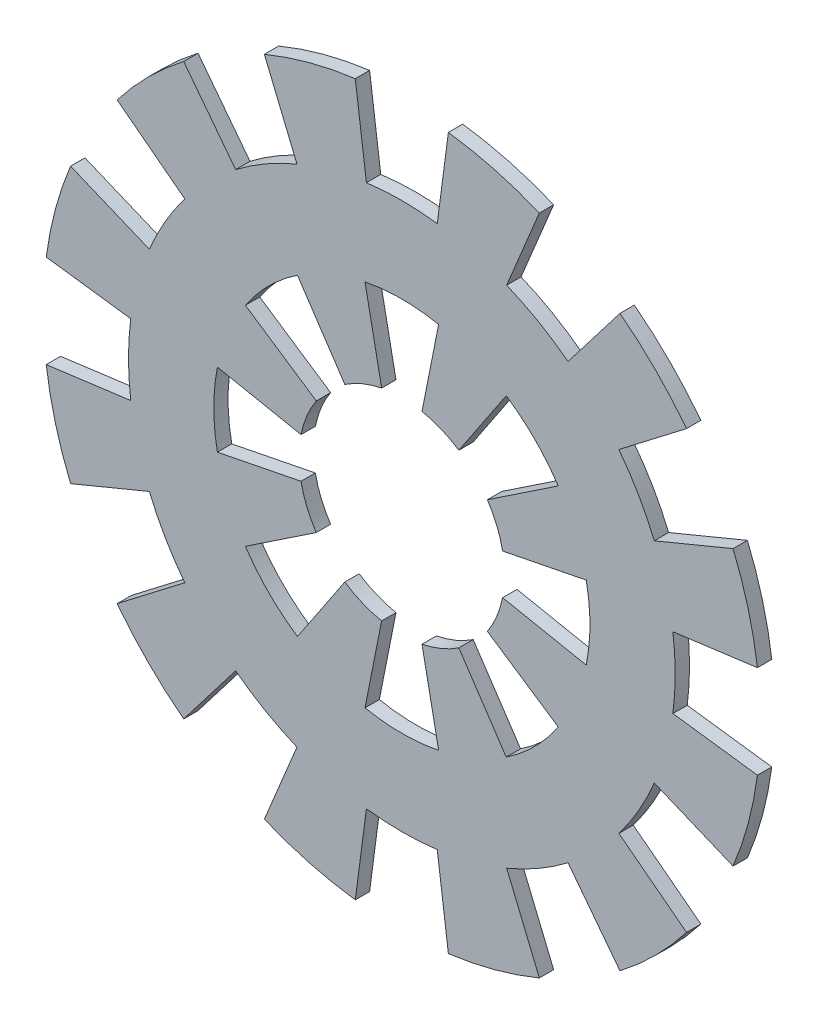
ISO-10303-21;
HEADER;
FILE_DESCRIPTION(('STEP AP214'),'2;1');
FILE_NAME('part.step','',(''),(''),'','','');
FILE_SCHEMA(('AUTOMOTIVE_DESIGN { 1 0 10303 214 1 1 1 1 }'));
ENDSEC;
DATA;
#1=APPLICATION_CONTEXT('core data for automotive mechanical design processes');
#2=APPLICATION_PROTOCOL_DEFINITION('international standard','automotive_design',2000,#1);
#3=PRODUCT_CONTEXT('',#1,'mechanical');
#4=PRODUCT('Part','Part','',(#3));
#5=PRODUCT_RELATED_PRODUCT_CATEGORY('part','',(#4));
#6=PRODUCT_DEFINITION_FORMATION('','',#4);
#7=PRODUCT_DEFINITION_CONTEXT('part definition',#1,'design');
#8=PRODUCT_DEFINITION('design','',#6,#7);
#9=PRODUCT_DEFINITION_SHAPE('','',#8);
#10=(LENGTH_UNIT() NAMED_UNIT(*) SI_UNIT(.MILLI.,.METRE.));
#11=(NAMED_UNIT(*) PLANE_ANGLE_UNIT() SI_UNIT($,.RADIAN.));
#12=(NAMED_UNIT(*) SI_UNIT($,.STERADIAN.) SOLID_ANGLE_UNIT());
#13=UNCERTAINTY_MEASURE_WITH_UNIT(LENGTH_MEASURE(1.E-05),#10,'distance_accuracy_value','');
#14=(GEOMETRIC_REPRESENTATION_CONTEXT(3) GLOBAL_UNCERTAINTY_ASSIGNED_CONTEXT((#13)) GLOBAL_UNIT_ASSIGNED_CONTEXT((#10,
#11,#12)) REPRESENTATION_CONTEXT('',''));
#15=CARTESIAN_POINT('',(0.,0.,0.));
#16=DIRECTION('',(0.,0.,1.));
#17=DIRECTION('',(1.,0.,0.));
#18=AXIS2_PLACEMENT_3D('',#15,#16,#17);
#19=CARTESIAN_POINT('',(0.,0.,0.));
#20=DIRECTION('',(0.,0.,1.));
#21=DIRECTION('',(1.,0.,0.));
#22=AXIS2_PLACEMENT_3D('',#19,#20,#21);
#23=CYLINDRICAL_SURFACE('',#22,7.5);
#24=DIRECTION('',(0.,0.,1.));
#25=VECTOR('',#24,1.);
#26=CARTESIAN_POINT('',(5.95355607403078,4.56126847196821,0.));
#27=LINE('',#26,#25);
#28=CARTESIAN_POINT('',(5.95355607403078,4.56126847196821,-0.3));
#29=VERTEX_POINT('',#28);
#30=CARTESIAN_POINT('',(5.95355607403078,4.56126847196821,0.));
#31=VERTEX_POINT('',#30);
#32=EDGE_CURVE('E561',#29,#31,#27,.T.);
#33=ORIENTED_EDGE('',*,*,#32,.F.);
#34=CARTESIAN_POINT('',(0.,0.,-0.3));
#35=DIRECTION('',(0.,0.,1.));
#36=DIRECTION('',(1.,0.,0.));
#37=AXIS2_PLACEMENT_3D('',#34,#35,#36);
#38=CIRCLE('',#37,7.5);
#39=CARTESIAN_POINT('',(4.56126847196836,5.95355607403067,-0.3));
#40=VERTEX_POINT('',#39);
#41=EDGE_CURVE('E1064',#29,#40,#38,.T.);
#42=ORIENTED_EDGE('',*,*,#41,.T.);
#43=DIRECTION('',(0.,0.,1.));
#44=VECTOR('',#43,1.);
#45=CARTESIAN_POINT('',(4.56126847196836,5.95355607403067,0.));
#46=LINE('',#45,#44);
#47=CARTESIAN_POINT('',(4.56126847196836,5.95355607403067,0.));
#48=VERTEX_POINT('',#47);
#49=EDGE_CURVE('E579',#48,#40,#46,.F.);
#50=ORIENTED_EDGE('',*,*,#49,.F.);
#51=CARTESIAN_POINT('',(0.,0.,0.));
#52=DIRECTION('',(0.,0.,1.));
#53=DIRECTION('',(1.,0.,0.));
#54=AXIS2_PLACEMENT_3D('',#51,#52,#53);
#55=CIRCLE('',#54,7.5);
#56=EDGE_CURVE('E1060',#31,#48,#55,.T.);
#57=ORIENTED_EDGE('',*,*,#56,.F.);
#58=EDGE_LOOP('',(#33,#42,#50,#57));
#59=FACE_BOUND('',#58,.T.);
#60=ADVANCED_FACE('F34',(#59),#23,.T.);
#61=DIRECTION('',(0.,0.,1.));
#62=VECTOR('',#61,1.);
#63=CARTESIAN_POINT('',(2.87529656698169,6.92695240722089,0.));
#64=LINE('',#63,#62);
#65=CARTESIAN_POINT('',(2.87529656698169,6.92695240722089,-0.3));
#66=VERTEX_POINT('',#65);
#67=CARTESIAN_POINT('',(2.87529656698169,6.92695240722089,0.));
#68=VERTEX_POINT('',#67);
#69=EDGE_CURVE('E583',#66,#68,#64,.T.);
#70=ORIENTED_EDGE('',*,*,#69,.F.);
#71=CARTESIAN_POINT('',(0.973396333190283,7.43656503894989,-0.3));
#72=VERTEX_POINT('',#71);
#73=EDGE_CURVE('E1107',#66,#72,#38,.T.);
#74=ORIENTED_EDGE('',*,*,#73,.T.);
#75=DIRECTION('',(0.,0.,1.));
#76=VECTOR('',#75,1.);
#77=CARTESIAN_POINT('',(0.973396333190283,7.43656503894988,0.));
#78=LINE('',#77,#76);
#79=CARTESIAN_POINT('',(0.973396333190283,7.43656503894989,0.));
#80=VERTEX_POINT('',#79);
#81=EDGE_CURVE('E603',#80,#72,#78,.F.);
#82=ORIENTED_EDGE('',*,*,#81,.F.);
#83=EDGE_CURVE('E1197',#68,#80,#55,.T.);
#84=ORIENTED_EDGE('',*,*,#83,.F.);
#85=EDGE_LOOP('',(#70,#74,#82,#84));
#86=FACE_BOUND('',#85,.T.);
#87=ADVANCED_FACE('F1206',(#86),#23,.T.);
#88=DIRECTION('',(0.,0.,1.));
#89=VECTOR('',#88,1.);
#90=CARTESIAN_POINT('',(-0.973396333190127,7.43656503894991,0.));
#91=LINE('',#90,#89);
#92=CARTESIAN_POINT('',(-0.973396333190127,7.43656503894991,-0.3));
#93=VERTEX_POINT('',#92);
#94=CARTESIAN_POINT('',(-0.973396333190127,7.43656503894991,0.));
#95=VERTEX_POINT('',#94);
#96=EDGE_CURVE('E608',#93,#95,#91,.T.);
#97=ORIENTED_EDGE('',*,*,#96,.F.);
#98=CARTESIAN_POINT('',(-2.87529656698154,6.92695240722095,-0.3));
#99=VERTEX_POINT('',#98);
#100=EDGE_CURVE('E1108',#93,#99,#38,.T.);
#101=ORIENTED_EDGE('',*,*,#100,.T.);
#102=DIRECTION('',(0.,0.,1.));
#103=VECTOR('',#102,1.);
#104=CARTESIAN_POINT('',(-2.87529656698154,6.92695240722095,0.));
#105=LINE('',#104,#103);
#106=CARTESIAN_POINT('',(-2.87529656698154,6.92695240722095,0.));
#107=VERTEX_POINT('',#106);
#108=EDGE_CURVE('E628',#107,#99,#105,.F.);
#109=ORIENTED_EDGE('',*,*,#108,.F.);
#110=EDGE_CURVE('E1193',#95,#107,#55,.T.);
#111=ORIENTED_EDGE('',*,*,#110,.F.);
#112=EDGE_LOOP('',(#97,#101,#109,#111));
#113=FACE_BOUND('',#112,.T.);
#114=ADVANCED_FACE('F1208',(#113),#23,.T.);
#115=DIRECTION('',(0.,0.,1.));
#116=VECTOR('',#115,1.);
#117=CARTESIAN_POINT('',(-4.56126847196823,5.95355607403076,0.));
#118=LINE('',#117,#116);
#119=CARTESIAN_POINT('',(-4.56126847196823,5.95355607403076,-0.3));
#120=VERTEX_POINT('',#119);
#121=CARTESIAN_POINT('',(-4.56126847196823,5.95355607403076,0.));
#122=VERTEX_POINT('',#121);
#123=EDGE_CURVE('E633',#120,#122,#118,.T.);
#124=ORIENTED_EDGE('',*,*,#123,.F.);
#125=CARTESIAN_POINT('',(-5.95355607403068,4.56126847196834,-0.3));
#126=VERTEX_POINT('',#125);
#127=EDGE_CURVE('E1112',#120,#126,#38,.T.);
#128=ORIENTED_EDGE('',*,*,#127,.T.);
#129=DIRECTION('',(0.,0.,1.));
#130=VECTOR('',#129,1.);
#131=CARTESIAN_POINT('',(-5.95355607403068,4.56126847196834,0.));
#132=LINE('',#131,#130);
#133=CARTESIAN_POINT('',(-5.95355607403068,4.56126847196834,0.));
#134=VERTEX_POINT('',#133);
#135=EDGE_CURVE('E653',#134,#126,#132,.F.);
#136=ORIENTED_EDGE('',*,*,#135,.F.);
#137=EDGE_CURVE('E1189',#122,#134,#55,.T.);
#138=ORIENTED_EDGE('',*,*,#137,.F.);
#139=EDGE_LOOP('',(#124,#128,#136,#138));
#140=FACE_BOUND('',#139,.T.);
#141=ADVANCED_FACE('F1214',(#140),#23,.T.);
#142=DIRECTION('',(0.,0.,1.));
#143=VECTOR('',#142,1.);
#144=CARTESIAN_POINT('',(-6.9269524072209,2.87529656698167,0.));
#145=LINE('',#144,#143);
#146=CARTESIAN_POINT('',(-6.9269524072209,2.87529656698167,-0.3));
#147=VERTEX_POINT('',#146);
#148=CARTESIAN_POINT('',(-6.9269524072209,2.87529656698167,0.));
#149=VERTEX_POINT('',#148);
#150=EDGE_CURVE('E658',#147,#149,#145,.T.);
#151=ORIENTED_EDGE('',*,*,#150,.F.);
#152=CARTESIAN_POINT('',(-7.43656503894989,0.973396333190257,-0.3));
#153=VERTEX_POINT('',#152);
#154=EDGE_CURVE('E1117',#147,#153,#38,.T.);
#155=ORIENTED_EDGE('',*,*,#154,.T.);
#156=DIRECTION('',(0.,0.,1.));
#157=VECTOR('',#156,1.);
#158=CARTESIAN_POINT('',(-7.43656503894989,0.973396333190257,0.));
#159=LINE('',#158,#157);
#160=CARTESIAN_POINT('',(-7.43656503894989,0.973396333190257,0.));
#161=VERTEX_POINT('',#160);
#162=EDGE_CURVE('E678',#161,#153,#159,.F.);
#163=ORIENTED_EDGE('',*,*,#162,.F.);
#164=EDGE_CURVE('E1185',#149,#161,#55,.T.);
#165=ORIENTED_EDGE('',*,*,#164,.F.);
#166=EDGE_LOOP('',(#151,#155,#163,#165));
#167=FACE_BOUND('',#166,.T.);
#168=ADVANCED_FACE('F1917',(#167),#23,.T.);
#169=DIRECTION('',(0.,0.,1.));
#170=VECTOR('',#169,1.);
#171=CARTESIAN_POINT('',(-7.4365650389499,-0.973396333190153,0.));
#172=LINE('',#171,#170);
#173=CARTESIAN_POINT('',(-7.4365650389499,-0.973396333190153,-0.3));
#174=VERTEX_POINT('',#173);
#175=CARTESIAN_POINT('',(-7.4365650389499,-0.973396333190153,0.));
#176=VERTEX_POINT('',#175);
#177=EDGE_CURVE('E683',#174,#176,#172,.T.);
#178=ORIENTED_EDGE('',*,*,#177,.F.);
#179=CARTESIAN_POINT('',(-6.92695240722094,-2.87529656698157,-0.3));
#180=VERTEX_POINT('',#179);
#181=EDGE_CURVE('E1122',#174,#180,#38,.T.);
#182=ORIENTED_EDGE('',*,*,#181,.T.);
#183=DIRECTION('',(0.,0.,1.));
#184=VECTOR('',#183,1.);
#185=CARTESIAN_POINT('',(-6.92695240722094,-2.87529656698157,0.));
#186=LINE('',#185,#184);
#187=CARTESIAN_POINT('',(-6.92695240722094,-2.87529656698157,0.));
#188=VERTEX_POINT('',#187);
#189=EDGE_CURVE('E703',#188,#180,#186,.F.);
#190=ORIENTED_EDGE('',*,*,#189,.F.);
#191=EDGE_CURVE('E1181',#176,#188,#55,.T.);
#192=ORIENTED_EDGE('',*,*,#191,.F.);
#193=EDGE_LOOP('',(#178,#182,#190,#192));
#194=FACE_BOUND('',#193,.T.);
#195=ADVANCED_FACE('F1924',(#194),#23,.T.);
#196=DIRECTION('',(0.,0.,1.));
#197=VECTOR('',#196,1.);
#198=CARTESIAN_POINT('',(-5.95355607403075,-4.56126847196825,0.));
#199=LINE('',#198,#197);
#200=CARTESIAN_POINT('',(-5.95355607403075,-4.56126847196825,-0.3));
#201=VERTEX_POINT('',#200);
#202=CARTESIAN_POINT('',(-5.95355607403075,-4.56126847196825,0.));
#203=VERTEX_POINT('',#202);
#204=EDGE_CURVE('E708',#201,#203,#199,.T.);
#205=ORIENTED_EDGE('',*,*,#204,.F.);
#206=CARTESIAN_POINT('',(-4.56126847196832,-5.9535560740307,-0.3));
#207=VERTEX_POINT('',#206);
#208=EDGE_CURVE('E1127',#201,#207,#38,.T.);
#209=ORIENTED_EDGE('',*,*,#208,.T.);
#210=DIRECTION('',(0.,0.,1.));
#211=VECTOR('',#210,1.);
#212=CARTESIAN_POINT('',(-4.56126847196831,-5.9535560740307,0.));
#213=LINE('',#212,#211);
#214=CARTESIAN_POINT('',(-4.56126847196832,-5.9535560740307,0.));
#215=VERTEX_POINT('',#214);
#216=EDGE_CURVE('E728',#215,#207,#213,.F.);
#217=ORIENTED_EDGE('',*,*,#216,.F.);
#218=EDGE_CURVE('E1177',#203,#215,#55,.T.);
#219=ORIENTED_EDGE('',*,*,#218,.F.);
#220=EDGE_LOOP('',(#205,#209,#217,#219));
#221=FACE_BOUND('',#220,.T.);
#222=ADVANCED_FACE('F1931',(#221),#23,.T.);
#223=DIRECTION('',(0.,0.,1.));
#224=VECTOR('',#223,1.);
#225=CARTESIAN_POINT('',(-2.87529656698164,-6.92695240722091,0.));
#226=LINE('',#225,#224);
#227=CARTESIAN_POINT('',(-2.87529656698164,-6.92695240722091,-0.3));
#228=VERTEX_POINT('',#227);
#229=CARTESIAN_POINT('',(-2.87529656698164,-6.92695240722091,0.));
#230=VERTEX_POINT('',#229);
#231=EDGE_CURVE('E733',#228,#230,#226,.T.);
#232=ORIENTED_EDGE('',*,*,#231,.F.);
#233=CARTESIAN_POINT('',(-0.973396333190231,-7.43656503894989,-0.3));
#234=VERTEX_POINT('',#233);
#235=EDGE_CURVE('E1132',#228,#234,#38,.T.);
#236=ORIENTED_EDGE('',*,*,#235,.T.);
#237=DIRECTION('',(0.,0.,1.));
#238=VECTOR('',#237,1.);
#239=CARTESIAN_POINT('',(-0.973396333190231,-7.43656503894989,0.));
#240=LINE('',#239,#238);
#241=CARTESIAN_POINT('',(-0.973396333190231,-7.43656503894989,0.));
#242=VERTEX_POINT('',#241);
#243=EDGE_CURVE('E753',#242,#234,#240,.F.);
#244=ORIENTED_EDGE('',*,*,#243,.F.);
#245=EDGE_CURVE('E1173',#230,#242,#55,.T.);
#246=ORIENTED_EDGE('',*,*,#245,.F.);
#247=EDGE_LOOP('',(#232,#236,#244,#246));
#248=FACE_BOUND('',#247,.T.);
#249=ADVANCED_FACE('F1938',(#248),#23,.T.);
#250=DIRECTION('',(0.,0.,1.));
#251=VECTOR('',#250,1.);
#252=CARTESIAN_POINT('',(0.973396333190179,-7.4365650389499,0.));
#253=LINE('',#252,#251);
#254=CARTESIAN_POINT('',(0.973396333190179,-7.4365650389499,-0.3));
#255=VERTEX_POINT('',#254);
#256=CARTESIAN_POINT('',(0.973396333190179,-7.4365650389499,0.));
#257=VERTEX_POINT('',#256);
#258=EDGE_CURVE('E758',#255,#257,#253,.T.);
#259=ORIENTED_EDGE('',*,*,#258,.F.);
#260=CARTESIAN_POINT('',(2.87529656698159,-6.92695240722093,-0.3));
#261=VERTEX_POINT('',#260);
#262=EDGE_CURVE('E1137',#255,#261,#38,.T.);
#263=ORIENTED_EDGE('',*,*,#262,.T.);
#264=DIRECTION('',(0.,0.,1.));
#265=VECTOR('',#264,1.);
#266=CARTESIAN_POINT('',(2.87529656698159,-6.92695240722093,0.));
#267=LINE('',#266,#265);
#268=CARTESIAN_POINT('',(2.87529656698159,-6.92695240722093,0.));
#269=VERTEX_POINT('',#268);
#270=EDGE_CURVE('E778',#269,#261,#267,.F.);
#271=ORIENTED_EDGE('',*,*,#270,.F.);
#272=EDGE_CURVE('E1169',#257,#269,#55,.T.);
#273=ORIENTED_EDGE('',*,*,#272,.F.);
#274=EDGE_LOOP('',(#259,#263,#271,#273));
#275=FACE_BOUND('',#274,.T.);
#276=ADVANCED_FACE('F1945',(#275),#23,.T.);
#277=DIRECTION('',(0.,0.,1.));
#278=VECTOR('',#277,1.);
#279=CARTESIAN_POINT('',(4.56126847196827,-5.95355607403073,0.));
#280=LINE('',#279,#278);
#281=CARTESIAN_POINT('',(4.56126847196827,-5.95355607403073,-0.3));
#282=VERTEX_POINT('',#281);
#283=CARTESIAN_POINT('',(4.56126847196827,-5.95355607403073,0.));
#284=VERTEX_POINT('',#283);
#285=EDGE_CURVE('E783',#282,#284,#280,.T.);
#286=ORIENTED_EDGE('',*,*,#285,.F.);
#287=CARTESIAN_POINT('',(5.95355607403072,-4.56126847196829,-0.3));
#288=VERTEX_POINT('',#287);
#289=EDGE_CURVE('E1142',#282,#288,#38,.T.);
#290=ORIENTED_EDGE('',*,*,#289,.T.);
#291=DIRECTION('',(0.,0.,1.));
#292=VECTOR('',#291,1.);
#293=CARTESIAN_POINT('',(5.95355607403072,-4.56126847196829,0.));
#294=LINE('',#293,#292);
#295=CARTESIAN_POINT('',(5.95355607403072,-4.56126847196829,0.));
#296=VERTEX_POINT('',#295);
#297=EDGE_CURVE('E803',#296,#288,#294,.F.);
#298=ORIENTED_EDGE('',*,*,#297,.F.);
#299=EDGE_CURVE('E1168',#284,#296,#55,.T.);
#300=ORIENTED_EDGE('',*,*,#299,.F.);
#301=EDGE_LOOP('',(#286,#290,#298,#300));
#302=FACE_BOUND('',#301,.T.);
#303=ADVANCED_FACE('F1952',(#302),#23,.T.);
#304=DIRECTION('',(0.,0.,1.));
#305=VECTOR('',#304,1.);
#306=CARTESIAN_POINT('',(6.92695240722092,-2.87529656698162,0.));
#307=LINE('',#306,#305);
#308=CARTESIAN_POINT('',(6.92695240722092,-2.87529656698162,-0.3));
#309=VERTEX_POINT('',#308);
#310=CARTESIAN_POINT('',(6.92695240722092,-2.87529656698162,0.));
#311=VERTEX_POINT('',#310);
#312=EDGE_CURVE('E808',#309,#311,#307,.T.);
#313=ORIENTED_EDGE('',*,*,#312,.F.);
#314=CARTESIAN_POINT('',(7.43656503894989,-0.973396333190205,-0.3));
#315=VERTEX_POINT('',#314);
#316=EDGE_CURVE('E1059',#309,#315,#38,.T.);
#317=ORIENTED_EDGE('',*,*,#316,.T.);
#318=DIRECTION('',(0.,0.,1.));
#319=VECTOR('',#318,1.);
#320=CARTESIAN_POINT('',(7.4365650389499,-0.973396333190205,0.));
#321=LINE('',#320,#319);
#322=CARTESIAN_POINT('',(7.4365650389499,-0.973396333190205,0.));
#323=VERTEX_POINT('',#322);
#324=EDGE_CURVE('E828',#323,#315,#321,.F.);
#325=ORIENTED_EDGE('',*,*,#324,.F.);
#326=EDGE_CURVE('E1054',#311,#323,#55,.T.);
#327=ORIENTED_EDGE('',*,*,#326,.F.);
#328=EDGE_LOOP('',(#313,#317,#325,#327));
#329=FACE_BOUND('',#328,.T.);
#330=ADVANCED_FACE('F1155',(#329),#23,.T.);
#331=DIRECTION('',(0.,0.,1.));
#332=VECTOR('',#331,1.);
#333=CARTESIAN_POINT('',(6.92695240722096,2.87529656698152,0.));
#334=LINE('',#333,#332);
#335=CARTESIAN_POINT('',(6.92695240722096,2.87529656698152,0.));
#336=VERTEX_POINT('',#335);
#337=CARTESIAN_POINT('',(6.92695240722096,2.87529656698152,-0.3));
#338=VERTEX_POINT('',#337);
#339=EDGE_CURVE('E545',#336,#338,#334,.F.);
#340=ORIENTED_EDGE('',*,*,#339,.F.);
#341=CARTESIAN_POINT('',(7.4365650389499,0.973396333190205,0.));
#342=VERTEX_POINT('',#341);
#343=EDGE_CURVE('E1056',#342,#336,#55,.T.);
#344=ORIENTED_EDGE('',*,*,#343,.F.);
#345=DIRECTION('',(0.,0.,1.));
#346=VECTOR('',#345,1.);
#347=CARTESIAN_POINT('',(7.4365650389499,0.973396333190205,0.));
#348=LINE('',#347,#346);
#349=CARTESIAN_POINT('',(7.43656503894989,0.973396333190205,-0.3));
#350=VERTEX_POINT('',#349);
#351=EDGE_CURVE('E833',#350,#342,#348,.T.);
#352=ORIENTED_EDGE('',*,*,#351,.F.);
#353=EDGE_CURVE('E1061',#350,#338,#38,.T.);
#354=ORIENTED_EDGE('',*,*,#353,.T.);
#355=EDGE_LOOP('',(#340,#344,#352,#354));
#356=FACE_BOUND('',#355,.T.);
#357=ADVANCED_FACE('F1215',(#356),#23,.T.);
#358=CARTESIAN_POINT('',(0.,0.,0.));
#359=DIRECTION('',(0.,0.,1.));
#360=DIRECTION('',(1.,0.,0.));
#361=AXIS2_PLACEMENT_3D('',#358,#359,#360);
#362=CYLINDRICAL_SURFACE('',#361,2.15);
#363=DIRECTION('',(0.,0.,1.));
#364=VECTOR('',#363,1.);
#365=CARTESIAN_POINT('',(-1.19217956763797,1.78919196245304,-0.3));
#366=LINE('',#365,#364);
#367=CARTESIAN_POINT('',(-1.19217956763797,1.78919196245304,-0.3));
#368=VERTEX_POINT('',#367);
#369=CARTESIAN_POINT('',(-1.19217956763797,1.78919196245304,0.));
#370=VERTEX_POINT('',#369);
#371=EDGE_CURVE('E855',#368,#370,#366,.T.);
#372=ORIENTED_EDGE('',*,*,#371,.F.);
#373=CARTESIAN_POINT('',(0.,0.,-0.3));
#374=DIRECTION('',(0.,0.,1.));
#375=DIRECTION('',(1.,0.,0.));
#376=AXIS2_PLACEMENT_3D('',#373,#374,#375);
#377=CIRCLE('',#376,2.15);
#378=CARTESIAN_POINT('',(-0.422151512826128,2.10814802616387,-0.3));
#379=VERTEX_POINT('',#378);
#380=EDGE_CURVE('E1065',#379,#368,#377,.T.);
#381=ORIENTED_EDGE('',*,*,#380,.F.);
#382=DIRECTION('',(0.,0.,1.));
#383=VECTOR('',#382,1.);
#384=CARTESIAN_POINT('',(-0.422151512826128,2.10814802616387,-0.3));
#385=LINE('',#384,#383);
#386=CARTESIAN_POINT('',(-0.422151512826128,2.10814802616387,0.));
#387=VERTEX_POINT('',#386);
#388=EDGE_CURVE('E1046',#379,#387,#385,.T.);
#389=ORIENTED_EDGE('',*,*,#388,.T.);
#390=CARTESIAN_POINT('',(0.,0.,0.));
#391=DIRECTION('',(0.,0.,1.));
#392=DIRECTION('',(1.,0.,0.));
#393=AXIS2_PLACEMENT_3D('',#390,#391,#392);
#394=CIRCLE('',#393,2.15);
#395=EDGE_CURVE('E1051',#387,#370,#394,.T.);
#396=ORIENTED_EDGE('',*,*,#395,.T.);
#397=EDGE_LOOP('',(#372,#381,#389,#396));
#398=FACE_BOUND('',#397,.T.);
#399=ADVANCED_FACE('F1218',(#398),#362,.F.);
#400=DIRECTION('',(0.,0.,1.));
#401=VECTOR('',#400,1.);
#402=CARTESIAN_POINT('',(-1.78919196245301,1.19217956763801,-0.3));
#403=LINE('',#402,#401);
#404=CARTESIAN_POINT('',(-1.78919196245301,1.19217956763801,-0.3));
#405=VERTEX_POINT('',#404);
#406=CARTESIAN_POINT('',(-1.78919196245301,1.19217956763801,0.));
#407=VERTEX_POINT('',#406);
#408=EDGE_CURVE('E857',#405,#407,#403,.T.);
#409=ORIENTED_EDGE('',*,*,#408,.T.);
#410=CARTESIAN_POINT('',(-2.10814802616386,0.422151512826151,0.));
#411=VERTEX_POINT('',#410);
#412=EDGE_CURVE('E1055',#407,#411,#394,.T.);
#413=ORIENTED_EDGE('',*,*,#412,.T.);
#414=DIRECTION('',(0.,0.,1.));
#415=VECTOR('',#414,1.);
#416=CARTESIAN_POINT('',(-2.10814802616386,0.422151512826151,-0.3));
#417=LINE('',#416,#415);
#418=CARTESIAN_POINT('',(-2.10814802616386,0.422151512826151,-0.3));
#419=VERTEX_POINT('',#418);
#420=EDGE_CURVE('E881',#419,#411,#417,.T.);
#421=ORIENTED_EDGE('',*,*,#420,.F.);
#422=EDGE_CURVE('E1069',#405,#419,#377,.T.);
#423=ORIENTED_EDGE('',*,*,#422,.F.);
#424=EDGE_LOOP('',(#409,#413,#421,#423));
#425=FACE_BOUND('',#424,.T.);
#426=ADVANCED_FACE('F1235',(#425),#362,.F.);
#427=DIRECTION('',(0.,0.,1.));
#428=VECTOR('',#427,1.);
#429=CARTESIAN_POINT('',(-2.10814802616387,-0.422151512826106,-0.3));
#430=LINE('',#429,#428);
#431=CARTESIAN_POINT('',(-2.10814802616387,-0.422151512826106,-0.3));
#432=VERTEX_POINT('',#431);
#433=CARTESIAN_POINT('',(-2.10814802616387,-0.422151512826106,0.));
#434=VERTEX_POINT('',#433);
#435=EDGE_CURVE('E884',#432,#434,#430,.T.);
#436=ORIENTED_EDGE('',*,*,#435,.T.);
#437=CARTESIAN_POINT('',(-1.78919196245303,-1.19217956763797,0.));
#438=VERTEX_POINT('',#437);
#439=EDGE_CURVE('E1301',#434,#438,#394,.T.);
#440=ORIENTED_EDGE('',*,*,#439,.T.);
#441=DIRECTION('',(0.,0.,1.));
#442=VECTOR('',#441,1.);
#443=CARTESIAN_POINT('',(-1.78919196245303,-1.19217956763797,-0.3));
#444=LINE('',#443,#442);
#445=CARTESIAN_POINT('',(-1.78919196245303,-1.19217956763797,-0.3));
#446=VERTEX_POINT('',#445);
#447=EDGE_CURVE('E908',#446,#438,#444,.T.);
#448=ORIENTED_EDGE('',*,*,#447,.F.);
#449=EDGE_CURVE('E1265',#432,#446,#377,.T.);
#450=ORIENTED_EDGE('',*,*,#449,.F.);
#451=EDGE_LOOP('',(#436,#440,#448,#450));
#452=FACE_BOUND('',#451,.T.);
#453=ADVANCED_FACE('F1240',(#452),#362,.F.);
#454=DIRECTION('',(0.,0.,1.));
#455=VECTOR('',#454,1.);
#456=CARTESIAN_POINT('',(-1.19217956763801,-1.78919196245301,-0.3));
#457=LINE('',#456,#455);
#458=CARTESIAN_POINT('',(-1.19217956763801,-1.78919196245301,-0.3));
#459=VERTEX_POINT('',#458);
#460=CARTESIAN_POINT('',(-1.19217956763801,-1.78919196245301,0.));
#461=VERTEX_POINT('',#460);
#462=EDGE_CURVE('E911',#459,#461,#457,.T.);
#463=ORIENTED_EDGE('',*,*,#462,.T.);
#464=CARTESIAN_POINT('',(-0.422151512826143,-2.10814802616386,0.));
#465=VERTEX_POINT('',#464);
#466=EDGE_CURVE('E1297',#461,#465,#394,.T.);
#467=ORIENTED_EDGE('',*,*,#466,.T.);
#468=DIRECTION('',(0.,0.,1.));
#469=VECTOR('',#468,1.);
#470=CARTESIAN_POINT('',(-0.422151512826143,-2.10814802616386,-0.3));
#471=LINE('',#470,#469);
#472=CARTESIAN_POINT('',(-0.422151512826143,-2.10814802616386,-0.3));
#473=VERTEX_POINT('',#472);
#474=EDGE_CURVE('E935',#473,#465,#471,.T.);
#475=ORIENTED_EDGE('',*,*,#474,.F.);
#476=EDGE_CURVE('E1266',#459,#473,#377,.T.);
#477=ORIENTED_EDGE('',*,*,#476,.F.);
#478=EDGE_LOOP('',(#463,#467,#475,#477));
#479=FACE_BOUND('',#478,.T.);
#480=ADVANCED_FACE('F1330',(#479),#362,.F.);
#481=DIRECTION('',(0.,0.,1.));
#482=VECTOR('',#481,1.);
#483=CARTESIAN_POINT('',(0.422151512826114,-2.10814802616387,-0.3));
#484=LINE('',#483,#482);
#485=CARTESIAN_POINT('',(0.422151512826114,-2.10814802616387,-0.3));
#486=VERTEX_POINT('',#485);
#487=CARTESIAN_POINT('',(0.422151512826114,-2.10814802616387,0.));
#488=VERTEX_POINT('',#487);
#489=EDGE_CURVE('E938',#486,#488,#484,.T.);
#490=ORIENTED_EDGE('',*,*,#489,.T.);
#491=CARTESIAN_POINT('',(1.19217956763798,-1.78919196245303,0.));
#492=VERTEX_POINT('',#491);
#493=EDGE_CURVE('E1293',#488,#492,#394,.T.);
#494=ORIENTED_EDGE('',*,*,#493,.T.);
#495=DIRECTION('',(0.,0.,1.));
#496=VECTOR('',#495,1.);
#497=CARTESIAN_POINT('',(1.19217956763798,-1.78919196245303,-0.3));
#498=LINE('',#497,#496);
#499=CARTESIAN_POINT('',(1.19217956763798,-1.78919196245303,-0.3));
#500=VERTEX_POINT('',#499);
#501=EDGE_CURVE('E962',#500,#492,#498,.T.);
#502=ORIENTED_EDGE('',*,*,#501,.F.);
#503=EDGE_CURVE('E1269',#486,#500,#377,.T.);
#504=ORIENTED_EDGE('',*,*,#503,.F.);
#505=EDGE_LOOP('',(#490,#494,#502,#504));
#506=FACE_BOUND('',#505,.T.);
#507=ADVANCED_FACE('F1342',(#506),#362,.F.);
#508=DIRECTION('',(0.,0.,1.));
#509=VECTOR('',#508,1.);
#510=CARTESIAN_POINT('',(1.78919196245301,-1.192179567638,-0.3));
#511=LINE('',#510,#509);
#512=CARTESIAN_POINT('',(1.78919196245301,-1.192179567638,-0.3));
#513=VERTEX_POINT('',#512);
#514=CARTESIAN_POINT('',(1.78919196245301,-1.192179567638,0.));
#515=VERTEX_POINT('',#514);
#516=EDGE_CURVE('E965',#513,#515,#511,.T.);
#517=ORIENTED_EDGE('',*,*,#516,.T.);
#518=CARTESIAN_POINT('',(2.10814802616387,-0.422151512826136,0.));
#519=VERTEX_POINT('',#518);
#520=EDGE_CURVE('E1290',#515,#519,#394,.T.);
#521=ORIENTED_EDGE('',*,*,#520,.T.);
#522=DIRECTION('',(0.,0.,1.));
#523=VECTOR('',#522,1.);
#524=CARTESIAN_POINT('',(2.10814802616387,-0.422151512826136,-0.3));
#525=LINE('',#524,#523);
#526=CARTESIAN_POINT('',(2.10814802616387,-0.422151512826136,-0.3));
#527=VERTEX_POINT('',#526);
#528=EDGE_CURVE('E989',#527,#519,#525,.T.);
#529=ORIENTED_EDGE('',*,*,#528,.F.);
#530=EDGE_CURVE('E1272',#513,#527,#377,.T.);
#531=ORIENTED_EDGE('',*,*,#530,.F.);
#532=EDGE_LOOP('',(#517,#521,#529,#531));
#533=FACE_BOUND('',#532,.T.);
#534=ADVANCED_FACE('F1232',(#533),#362,.F.);
#535=DIRECTION('',(0.,0.,1.));
#536=VECTOR('',#535,1.);
#537=CARTESIAN_POINT('',(2.10814802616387,0.422151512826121,-0.3));
#538=LINE('',#537,#536);
#539=CARTESIAN_POINT('',(2.10814802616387,0.422151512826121,-0.3));
#540=VERTEX_POINT('',#539);
#541=CARTESIAN_POINT('',(2.10814802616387,0.422151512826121,0.));
#542=VERTEX_POINT('',#541);
#543=EDGE_CURVE('E992',#540,#542,#538,.T.);
#544=ORIENTED_EDGE('',*,*,#543,.T.);
#545=CARTESIAN_POINT('',(1.78919196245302,1.19217956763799,0.));
#546=VERTEX_POINT('',#545);
#547=EDGE_CURVE('E1289',#542,#546,#394,.T.);
#548=ORIENTED_EDGE('',*,*,#547,.T.);
#549=DIRECTION('',(0.,0.,1.));
#550=VECTOR('',#549,1.);
#551=CARTESIAN_POINT('',(1.78919196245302,1.19217956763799,-0.3));
#552=LINE('',#551,#550);
#553=CARTESIAN_POINT('',(1.78919196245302,1.19217956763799,-0.3));
#554=VERTEX_POINT('',#553);
#555=EDGE_CURVE('E1016',#554,#546,#552,.T.);
#556=ORIENTED_EDGE('',*,*,#555,.F.);
#557=EDGE_CURVE('E1275',#540,#554,#377,.T.);
#558=ORIENTED_EDGE('',*,*,#557,.F.);
#559=EDGE_LOOP('',(#544,#548,#556,#558));
#560=FACE_BOUND('',#559,.T.);
#561=ADVANCED_FACE('F1227',(#560),#362,.F.);
#562=DIRECTION('',(0.,0.,1.));
#563=VECTOR('',#562,1.);
#564=CARTESIAN_POINT('',(1.19217956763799,1.78919196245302,-0.3));
#565=LINE('',#564,#563);
#566=CARTESIAN_POINT('',(1.19217956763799,1.78919196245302,-0.3));
#567=VERTEX_POINT('',#566);
#568=CARTESIAN_POINT('',(1.19217956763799,1.78919196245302,0.));
#569=VERTEX_POINT('',#568);
#570=EDGE_CURVE('E1019',#567,#569,#565,.T.);
#571=ORIENTED_EDGE('',*,*,#570,.T.);
#572=CARTESIAN_POINT('',(0.422151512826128,2.10814802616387,0.));
#573=VERTEX_POINT('',#572);
#574=EDGE_CURVE('E1042',#569,#573,#394,.T.);
#575=ORIENTED_EDGE('',*,*,#574,.T.);
#576=DIRECTION('',(0.,0.,1.));
#577=VECTOR('',#576,1.);
#578=CARTESIAN_POINT('',(0.422151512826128,2.10814802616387,-0.3));
#579=LINE('',#578,#577);
#580=CARTESIAN_POINT('',(0.422151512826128,2.10814802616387,-0.3));
#581=VERTEX_POINT('',#580);
#582=EDGE_CURVE('E1043',#581,#573,#579,.T.);
#583=ORIENTED_EDGE('',*,*,#582,.F.);
#584=EDGE_CURVE('E1063',#567,#581,#377,.T.);
#585=ORIENTED_EDGE('',*,*,#584,.F.);
#586=EDGE_LOOP('',(#571,#575,#583,#585));
#587=FACE_BOUND('',#586,.T.);
#588=ADVANCED_FACE('F36',(#587),#362,.F.);
#589=CARTESIAN_POINT('',(2.15,0.,-0.3));
#590=DIRECTION('',(0.,0.,-1.));
#591=DIRECTION('',(-1.,0.,0.));
#592=AXIS2_PLACEMENT_3D('',#589,#590,#591);
#593=PLANE('',#592);
#594=DIRECTION('',(-0.793353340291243,-0.608761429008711,0.));
#595=VECTOR('',#594,1.);
#596=CARTESIAN_POINT('',(6.00431667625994,4.60021845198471,-0.3));
#597=LINE('',#596,#595);
#598=CARTESIAN_POINT('',(4.53874210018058,3.47564352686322,-0.3));
#599=VERTEX_POINT('',#598);
#600=EDGE_CURVE('E539',#29,#599,#597,.T.);
#601=ORIENTED_EDGE('',*,*,#600,.T.);
#602=CARTESIAN_POINT('',(0.,0.,-0.3));
#603=DIRECTION('',(0.,0.,-1.));
#604=DIRECTION('',(0.866025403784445,0.499999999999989,0.));
#605=AXIS2_PLACEMENT_3D('',#602,#603,#604);
#606=CIRCLE('',#605,5.71666666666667);
#607=CARTESIAN_POINT('',(5.27936663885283,2.19284419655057,-0.3));
#608=VERTEX_POINT('',#607);
#609=EDGE_CURVE('E534',#599,#608,#606,.T.);
#610=ORIENTED_EDGE('',*,*,#609,.T.);
#611=DIRECTION('',(0.923879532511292,0.382683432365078,0.));
#612=VECTOR('',#611,1.);
#613=CARTESIAN_POINT('',(6.98606438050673,2.89978154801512,-0.3));
#614=LINE('',#613,#612);
#615=EDGE_CURVE('E542',#608,#338,#614,.T.);
#616=ORIENTED_EDGE('',*,*,#615,.T.);
#617=ORIENTED_EDGE('',*,*,#353,.F.);
#618=DIRECTION('',(-0.99144486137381,-0.130526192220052,0.));
#619=VECTOR('',#618,1.);
#620=CARTESIAN_POINT('',(7.5,0.98174770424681,-0.3));
#621=LINE('',#620,#619);
#622=CARTESIAN_POINT('',(5.66848772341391,0.740624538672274,-0.3));
#623=VERTEX_POINT('',#622);
#624=EDGE_CURVE('E818',#350,#623,#621,.T.);
#625=ORIENTED_EDGE('',*,*,#624,.T.);
#626=CARTESIAN_POINT('',(0.,0.,-0.3));
#627=DIRECTION('',(0.,0.,-1.));
#628=DIRECTION('',(1.,0.,0.));
#629=AXIS2_PLACEMENT_3D('',#626,#627,#628);
#630=CIRCLE('',#629,5.71666666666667);
#631=CARTESIAN_POINT('',(5.66848772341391,-0.740624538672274,-0.3));
#632=VERTEX_POINT('',#631);
#633=EDGE_CURVE('E811',#623,#632,#630,.T.);
#634=ORIENTED_EDGE('',*,*,#633,.T.);
#635=DIRECTION('',(0.99144486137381,-0.130526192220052,0.));
#636=VECTOR('',#635,1.);
#637=CARTESIAN_POINT('',(7.5,-0.98174770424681,-0.3));
#638=LINE('',#637,#636);
#639=EDGE_CURVE('E814',#632,#315,#638,.T.);
#640=ORIENTED_EDGE('',*,*,#639,.T.);
#641=ORIENTED_EDGE('',*,*,#316,.F.);
#642=DIRECTION('',(-0.923879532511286,0.382683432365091,0.));
#643=VECTOR('',#642,1.);
#644=CARTESIAN_POINT('',(6.98606438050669,-2.89978154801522,-0.3));
#645=LINE('',#644,#643);
#646=CARTESIAN_POINT('',(5.2793666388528,-2.19284419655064,-0.3));
#647=VERTEX_POINT('',#646);
#648=EDGE_CURVE('E793',#309,#647,#645,.T.);
#649=ORIENTED_EDGE('',*,*,#648,.T.);
#650=CARTESIAN_POINT('',(0.,0.,-0.3));
#651=DIRECTION('',(0.,0.,-1.));
#652=DIRECTION('',(0.866025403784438,-0.500000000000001,0.));
#653=AXIS2_PLACEMENT_3D('',#650,#651,#652);
#654=CIRCLE('',#653,5.71666666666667);
#655=CARTESIAN_POINT('',(4.53874210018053,-3.47564352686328,-0.3));
#656=VERTEX_POINT('',#655);
#657=EDGE_CURVE('E786',#647,#656,#654,.T.);
#658=ORIENTED_EDGE('',*,*,#657,.T.);
#659=DIRECTION('',(0.793353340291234,-0.608761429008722,0.));
#660=VECTOR('',#659,1.);
#661=CARTESIAN_POINT('',(6.00431667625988,-4.6002184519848,-0.3));
#662=LINE('',#661,#660);
#663=EDGE_CURVE('E789',#656,#288,#662,.T.);
#664=ORIENTED_EDGE('',*,*,#663,.T.);
#665=ORIENTED_EDGE('',*,*,#289,.F.);
#666=DIRECTION('',(-0.608761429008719,0.793353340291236,0.));
#667=VECTOR('',#666,1.);
#668=CARTESIAN_POINT('',(4.60021845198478,-6.0043166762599,-0.3));
#669=LINE('',#668,#667);
#670=CARTESIAN_POINT('',(3.47564352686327,-4.53874210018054,-0.3));
#671=VERTEX_POINT('',#670);
#672=EDGE_CURVE('E768',#282,#671,#669,.T.);
#673=ORIENTED_EDGE('',*,*,#672,.T.);
#674=CARTESIAN_POINT('',(0.,0.,-0.3));
#675=DIRECTION('',(0.,0.,-1.));
#676=DIRECTION('',(0.499999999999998,-0.86602540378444,0.));
#677=AXIS2_PLACEMENT_3D('',#674,#675,#676);
#678=CIRCLE('',#677,5.71666666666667);
#679=CARTESIAN_POINT('',(2.19284419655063,-5.27936663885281,-0.3));
#680=VERTEX_POINT('',#679);
#681=EDGE_CURVE('E761',#671,#680,#678,.T.);
#682=ORIENTED_EDGE('',*,*,#681,.T.);
#683=DIRECTION('',(0.382683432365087,-0.923879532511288,0.));
#684=VECTOR('',#683,1.);
#685=CARTESIAN_POINT('',(2.89978154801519,-6.9860643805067,-0.3));
#686=LINE('',#685,#684);
#687=EDGE_CURVE('E764',#680,#261,#686,.T.);
#688=ORIENTED_EDGE('',*,*,#687,.T.);
#689=ORIENTED_EDGE('',*,*,#262,.F.);
#690=DIRECTION('',(-0.130526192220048,0.991444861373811,0.));
#691=VECTOR('',#690,1.);
#692=CARTESIAN_POINT('',(0.981747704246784,-7.5,-0.3));
#693=LINE('',#692,#691);
#694=CARTESIAN_POINT('',(0.740624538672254,-5.66848772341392,-0.3));
#695=VERTEX_POINT('',#694);
#696=EDGE_CURVE('E743',#255,#695,#693,.T.);
#697=ORIENTED_EDGE('',*,*,#696,.T.);
#698=CARTESIAN_POINT('',(0.,0.,-0.3));
#699=DIRECTION('',(0.,0.,-1.));
#700=DIRECTION('',(0.,-1.,0.));
#701=AXIS2_PLACEMENT_3D('',#698,#699,#700);
#702=CIRCLE('',#701,5.71666666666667);
#703=CARTESIAN_POINT('',(-0.740624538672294,-5.66848772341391,-0.3));
#704=VERTEX_POINT('',#703);
#705=EDGE_CURVE('E736',#695,#704,#702,.T.);
#706=ORIENTED_EDGE('',*,*,#705,.T.);
#707=DIRECTION('',(-0.130526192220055,-0.99144486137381,0.));
#708=VECTOR('',#707,1.);
#709=CARTESIAN_POINT('',(-0.981747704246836,-7.5,-0.3));
#710=LINE('',#709,#708);
#711=EDGE_CURVE('E739',#704,#234,#710,.T.);
#712=ORIENTED_EDGE('',*,*,#711,.T.);
#713=ORIENTED_EDGE('',*,*,#235,.F.);
#714=DIRECTION('',(0.382683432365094,0.923879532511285,0.));
#715=VECTOR('',#714,1.);
#716=CARTESIAN_POINT('',(-2.89978154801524,-6.98606438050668,-0.3));
#717=LINE('',#716,#715);
#718=CARTESIAN_POINT('',(-2.19284419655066,-5.2793666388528,-0.3));
#719=VERTEX_POINT('',#718);
#720=EDGE_CURVE('E718',#228,#719,#717,.T.);
#721=ORIENTED_EDGE('',*,*,#720,.T.);
#722=CARTESIAN_POINT('',(0.,0.,-0.3));
#723=DIRECTION('',(0.,0.,-1.));
#724=DIRECTION('',(-0.500000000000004,-0.866025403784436,0.));
#725=AXIS2_PLACEMENT_3D('',#722,#723,#724);
#726=CIRCLE('',#725,5.71666666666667);
#727=CARTESIAN_POINT('',(-3.4756435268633,-4.53874210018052,-0.3));
#728=VERTEX_POINT('',#727);
#729=EDGE_CURVE('E711',#719,#728,#726,.T.);
#730=ORIENTED_EDGE('',*,*,#729,.T.);
#731=DIRECTION('',(-0.608761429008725,-0.793353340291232,0.));
#732=VECTOR('',#731,1.);
#733=CARTESIAN_POINT('',(-4.60021845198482,-6.00431667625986,-0.3));
#734=LINE('',#733,#732);
#735=EDGE_CURVE('E714',#728,#207,#734,.T.);
#736=ORIENTED_EDGE('',*,*,#735,.T.);
#737=ORIENTED_EDGE('',*,*,#208,.F.);
#738=DIRECTION('',(0.793353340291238,0.608761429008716,0.));
#739=VECTOR('',#738,1.);
#740=CARTESIAN_POINT('',(-6.00431667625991,-4.60021845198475,-0.3));
#741=LINE('',#740,#739);
#742=CARTESIAN_POINT('',(-4.53874210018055,-3.47564352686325,-0.3));
#743=VERTEX_POINT('',#742);
#744=EDGE_CURVE('E693',#201,#743,#741,.T.);
#745=ORIENTED_EDGE('',*,*,#744,.T.);
#746=CARTESIAN_POINT('',(0.,0.,-0.3));
#747=DIRECTION('',(0.,0.,-1.));
#748=DIRECTION('',(-0.866025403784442,-0.499999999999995,0.));
#749=AXIS2_PLACEMENT_3D('',#746,#747,#748);
#750=CIRCLE('',#749,5.71666666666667);
#751=CARTESIAN_POINT('',(-5.27936663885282,-2.19284419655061,-0.3));
#752=VERTEX_POINT('',#751);
#753=EDGE_CURVE('E686',#743,#752,#750,.T.);
#754=ORIENTED_EDGE('',*,*,#753,.T.);
#755=DIRECTION('',(-0.923879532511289,-0.382683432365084,0.));
#756=VECTOR('',#755,1.);
#757=CARTESIAN_POINT('',(-6.98606438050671,-2.89978154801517,-0.3));
#758=LINE('',#757,#756);
#759=EDGE_CURVE('E689',#752,#180,#758,.T.);
#760=ORIENTED_EDGE('',*,*,#759,.T.);
#761=ORIENTED_EDGE('',*,*,#181,.F.);
#762=DIRECTION('',(0.991444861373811,0.130526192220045,0.));
#763=VECTOR('',#762,1.);
#764=CARTESIAN_POINT('',(-7.50000000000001,-0.981747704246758,-0.3));
#765=LINE('',#764,#763);
#766=CARTESIAN_POINT('',(-5.66848772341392,-0.740624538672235,-0.3));
#767=VERTEX_POINT('',#766);
#768=EDGE_CURVE('E668',#174,#767,#765,.T.);
#769=ORIENTED_EDGE('',*,*,#768,.T.);
#770=CARTESIAN_POINT('',(0.,0.,-0.3));
#771=DIRECTION('',(0.,0.,-1.));
#772=DIRECTION('',(-1.,0.,0.));
#773=AXIS2_PLACEMENT_3D('',#770,#771,#772);
#774=CIRCLE('',#773,5.71666666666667);
#775=CARTESIAN_POINT('',(-5.66848772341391,0.740624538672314,-0.3));
#776=VERTEX_POINT('',#775);
#777=EDGE_CURVE('E661',#767,#776,#774,.T.);
#778=ORIENTED_EDGE('',*,*,#777,.T.);
#779=DIRECTION('',(-0.991444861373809,0.130526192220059,0.));
#780=VECTOR('',#779,1.);
#781=CARTESIAN_POINT('',(-7.49999999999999,0.981747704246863,-0.3));
#782=LINE('',#781,#780);
#783=EDGE_CURVE('E664',#776,#153,#782,.T.);
#784=ORIENTED_EDGE('',*,*,#783,.T.);
#785=ORIENTED_EDGE('',*,*,#154,.F.);
#786=DIRECTION('',(0.923879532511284,-0.382683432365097,0.));
#787=VECTOR('',#786,1.);
#788=CARTESIAN_POINT('',(-6.98606438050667,2.89978154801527,-0.3));
#789=LINE('',#788,#787);
#790=CARTESIAN_POINT('',(-5.27936663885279,2.19284419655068,-0.3));
#791=VERTEX_POINT('',#790);
#792=EDGE_CURVE('E643',#147,#791,#789,.T.);
#793=ORIENTED_EDGE('',*,*,#792,.T.);
#794=CARTESIAN_POINT('',(0.,0.,-0.3));
#795=DIRECTION('',(0.,0.,-1.));
#796=DIRECTION('',(-0.866025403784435,0.500000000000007,0.));
#797=AXIS2_PLACEMENT_3D('',#794,#795,#796);
#798=CIRCLE('',#797,5.71666666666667);
#799=CARTESIAN_POINT('',(-4.5387421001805,3.47564352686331,-0.3));
#800=VERTEX_POINT('',#799);
#801=EDGE_CURVE('E636',#791,#800,#798,.T.);
#802=ORIENTED_EDGE('',*,*,#801,.T.);
#803=DIRECTION('',(-0.79335334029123,0.608761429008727,0.));
#804=VECTOR('',#803,1.);
#805=CARTESIAN_POINT('',(-6.00431667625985,4.60021845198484,-0.3));
#806=LINE('',#805,#804);
#807=EDGE_CURVE('E639',#800,#126,#806,.T.);
#808=ORIENTED_EDGE('',*,*,#807,.T.);
#809=ORIENTED_EDGE('',*,*,#127,.F.);
#810=DIRECTION('',(0.608761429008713,-0.79335334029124,0.));
#811=VECTOR('',#810,1.);
#812=CARTESIAN_POINT('',(-4.60021845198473,6.00431667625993,-0.3));
#813=LINE('',#812,#811);
#814=CARTESIAN_POINT('',(-3.47564352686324,4.53874210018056,-0.3));
#815=VERTEX_POINT('',#814);
#816=EDGE_CURVE('E618',#120,#815,#813,.T.);
#817=ORIENTED_EDGE('',*,*,#816,.T.);
#818=CARTESIAN_POINT('',(0.,0.,-0.3));
#819=DIRECTION('',(0.,0.,-1.));
#820=DIRECTION('',(-0.499999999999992,0.866025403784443,0.));
#821=AXIS2_PLACEMENT_3D('',#818,#819,#820);
#822=CIRCLE('',#821,5.71666666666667);
#823=CARTESIAN_POINT('',(-2.19284419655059,5.27936663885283,-0.3));
#824=VERTEX_POINT('',#823);
#825=EDGE_CURVE('E611',#815,#824,#822,.T.);
#826=ORIENTED_EDGE('',*,*,#825,.T.);
#827=DIRECTION('',(-0.382683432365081,0.92387953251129,0.));
#828=VECTOR('',#827,1.);
#829=CARTESIAN_POINT('',(-2.89978154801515,6.98606438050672,-0.3));
#830=LINE('',#829,#828);
#831=EDGE_CURVE('E614',#824,#99,#830,.T.);
#832=ORIENTED_EDGE('',*,*,#831,.T.);
#833=ORIENTED_EDGE('',*,*,#100,.F.);
#834=DIRECTION('',(0.130526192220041,-0.991444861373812,0.));
#835=VECTOR('',#834,1.);
#836=CARTESIAN_POINT('',(-0.981747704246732,7.50000000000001,-0.3));
#837=LINE('',#836,#835);
#838=CARTESIAN_POINT('',(-0.740624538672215,5.66848772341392,-0.3));
#839=VERTEX_POINT('',#838);
#840=EDGE_CURVE('E593',#93,#839,#837,.T.);
#841=ORIENTED_EDGE('',*,*,#840,.T.);
#842=CARTESIAN_POINT('',(0.,0.,-0.3));
#843=DIRECTION('',(0.,0.,-1.));
#844=DIRECTION('',(0.,1.,0.));
#845=AXIS2_PLACEMENT_3D('',#842,#843,#844);
#846=CIRCLE('',#845,5.71666666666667);
#847=CARTESIAN_POINT('',(0.740624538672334,5.66848772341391,-0.3));
#848=VERTEX_POINT('',#847);
#849=EDGE_CURVE('E586',#839,#848,#846,.T.);
#850=ORIENTED_EDGE('',*,*,#849,.T.);
#851=DIRECTION('',(0.130526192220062,0.991444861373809,0.));
#852=VECTOR('',#851,1.);
#853=CARTESIAN_POINT('',(0.981747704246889,7.49999999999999,-0.3));
#854=LINE('',#853,#852);
#855=EDGE_CURVE('E589',#848,#72,#854,.T.);
#856=ORIENTED_EDGE('',*,*,#855,.T.);
#857=ORIENTED_EDGE('',*,*,#73,.F.);
#858=DIRECTION('',(-0.3826834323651,-0.923879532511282,0.));
#859=VECTOR('',#858,1.);
#860=CARTESIAN_POINT('',(2.89978154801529,6.98606438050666,-0.3));
#861=LINE('',#860,#859);
#862=CARTESIAN_POINT('',(2.1928441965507,5.27936663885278,-0.3));
#863=VERTEX_POINT('',#862);
#864=EDGE_CURVE('E570',#66,#863,#861,.T.);
#865=ORIENTED_EDGE('',*,*,#864,.T.);
#866=CARTESIAN_POINT('',(0.,0.,-0.3));
#867=DIRECTION('',(0.,0.,-1.));
#868=DIRECTION('',(0.50000000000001,0.866025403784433,0.));
#869=AXIS2_PLACEMENT_3D('',#866,#867,#868);
#870=CIRCLE('',#869,5.71666666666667);
#871=CARTESIAN_POINT('',(3.47564352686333,4.53874210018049,-0.3));
#872=VERTEX_POINT('',#871);
#873=EDGE_CURVE('E563',#863,#872,#870,.T.);
#874=ORIENTED_EDGE('',*,*,#873,.T.);
#875=DIRECTION('',(0.60876142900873,0.793353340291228,0.));
#876=VECTOR('',#875,1.);
#877=CARTESIAN_POINT('',(4.60021845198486,6.00431667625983,-0.3));
#878=LINE('',#877,#876);
#879=EDGE_CURVE('E566',#872,#40,#878,.T.);
#880=ORIENTED_EDGE('',*,*,#879,.T.);
#881=ORIENTED_EDGE('',*,*,#41,.F.);
#882=EDGE_LOOP('',(#601,#610,#616,#617,#625,#634,#640,#641,#649,#658,#664,#665,#673,#682,#688,
#689,#697,#706,#712,#713,#721,#730,#736,#737,#745,#754,#760,#761,#769,#778,#784,#785,#793,#802,
#808,#809,#817,#826,#832,#833,#841,#850,#856,#857,#865,#874,#880,#881));
#883=FACE_BOUND('',#882,.T.);
#884=DIRECTION('',(-0.555570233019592,0.831469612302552,0.));
#885=VECTOR('',#884,1.);
#886=CARTESIAN_POINT('',(-2.1829469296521,3.27198010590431,-0.3));
#887=LINE('',#886,#885);
#888=CARTESIAN_POINT('',(-2.1829469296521,3.27198010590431,-0.3));
#889=VERTEX_POINT('',#888);
#890=EDGE_CURVE('E843',#368,#889,#887,.T.);
#891=ORIENTED_EDGE('',*,*,#890,.T.);
#892=CARTESIAN_POINT('',(0.,0.,-0.3));
#893=DIRECTION('',(0.,0.,1.));
#894=DIRECTION('',(0.707106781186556,0.707106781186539,0.));
#895=AXIS2_PLACEMENT_3D('',#892,#893,#894);
#896=CIRCLE('',#895,3.93333333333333);
#897=CARTESIAN_POINT('',(-3.27198010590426,2.18294692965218,-0.3));
#898=VERTEX_POINT('',#897);
#899=EDGE_CURVE('E836',#889,#898,#896,.T.);
#900=ORIENTED_EDGE('',*,*,#899,.T.);
#901=DIRECTION('',(0.831469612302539,-0.555570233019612,0.));
#902=VECTOR('',#901,1.);
#903=CARTESIAN_POINT('',(-3.27198010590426,2.18294692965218,-0.3));
#904=LINE('',#903,#902);
#905=EDGE_CURVE('E839',#898,#405,#904,.T.);
#906=ORIENTED_EDGE('',*,*,#905,.T.);
#907=ORIENTED_EDGE('',*,*,#422,.T.);
#908=DIRECTION('',(-0.980785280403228,0.195090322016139,0.));
#909=VECTOR('',#908,1.);
#910=CARTESIAN_POINT('',(-3.85721589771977,0.770062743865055,-0.3));
#911=LINE('',#910,#909);
#912=CARTESIAN_POINT('',(-3.85721589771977,0.770062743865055,-0.3));
#913=VERTEX_POINT('',#912);
#914=EDGE_CURVE('E869',#419,#913,#911,.T.);
#915=ORIENTED_EDGE('',*,*,#914,.T.);
#916=CARTESIAN_POINT('',(0.,0.,-0.3));
#917=DIRECTION('',(0.,0.,1.));
#918=DIRECTION('',(0.,1.,0.));
#919=AXIS2_PLACEMENT_3D('',#916,#917,#918);
#920=CIRCLE('',#919,3.93333333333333);
#921=CARTESIAN_POINT('',(-3.85721589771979,-0.770062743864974,-0.3));
#922=VERTEX_POINT('',#921);
#923=EDGE_CURVE('E862',#913,#922,#920,.T.);
#924=ORIENTED_EDGE('',*,*,#923,.T.);
#925=DIRECTION('',(0.980785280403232,0.195090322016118,0.));
#926=VECTOR('',#925,1.);
#927=CARTESIAN_POINT('',(-3.85721589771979,-0.770062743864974,-0.3));
#928=LINE('',#927,#926);
#929=EDGE_CURVE('E865',#922,#432,#928,.T.);
#930=ORIENTED_EDGE('',*,*,#929,.T.);
#931=ORIENTED_EDGE('',*,*,#449,.T.);
#932=DIRECTION('',(-0.83146961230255,-0.555570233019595,0.));
#933=VECTOR('',#932,1.);
#934=CARTESIAN_POINT('',(-3.2719801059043,-2.18294692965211,-0.3));
#935=LINE('',#934,#933);
#936=CARTESIAN_POINT('',(-3.2719801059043,-2.18294692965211,-0.3));
#937=VERTEX_POINT('',#936);
#938=EDGE_CURVE('E896',#446,#937,#935,.T.);
#939=ORIENTED_EDGE('',*,*,#938,.T.);
#940=CARTESIAN_POINT('',(0.,0.,-0.3));
#941=DIRECTION('',(0.,0.,1.));
#942=DIRECTION('',(-0.707106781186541,0.707106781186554,0.));
#943=AXIS2_PLACEMENT_3D('',#940,#941,#942);
#944=CIRCLE('',#943,3.93333333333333);
#945=CARTESIAN_POINT('',(-2.18294692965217,-3.27198010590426,-0.3));
#946=VERTEX_POINT('',#945);
#947=EDGE_CURVE('E889',#937,#946,#944,.T.);
#948=ORIENTED_EDGE('',*,*,#947,.T.);
#949=DIRECTION('',(0.555570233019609,0.831469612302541,0.));
#950=VECTOR('',#949,1.);
#951=CARTESIAN_POINT('',(-2.18294692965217,-3.27198010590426,-0.3));
#952=LINE('',#951,#950);
#953=EDGE_CURVE('E892',#946,#459,#952,.T.);
#954=ORIENTED_EDGE('',*,*,#953,.T.);
#955=ORIENTED_EDGE('',*,*,#476,.T.);
#956=DIRECTION('',(-0.195090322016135,-0.980785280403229,0.));
#957=VECTOR('',#956,1.);
#958=CARTESIAN_POINT('',(-0.770062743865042,-3.85721589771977,-0.3));
#959=LINE('',#958,#957);
#960=CARTESIAN_POINT('',(-0.770062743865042,-3.85721589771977,-0.3));
#961=VERTEX_POINT('',#960);
#962=EDGE_CURVE('E923',#473,#961,#959,.T.);
#963=ORIENTED_EDGE('',*,*,#962,.T.);
#964=CARTESIAN_POINT('',(0.,0.,-0.3));
#965=DIRECTION('',(0.,0.,1.));
#966=DIRECTION('',(-1.,0.,0.));
#967=AXIS2_PLACEMENT_3D('',#964,#965,#966);
#968=CIRCLE('',#967,3.93333333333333);
#969=CARTESIAN_POINT('',(0.770062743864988,-3.85721589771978,-0.3));
#970=VERTEX_POINT('',#969);
#971=EDGE_CURVE('E916',#961,#970,#968,.T.);
#972=ORIENTED_EDGE('',*,*,#971,.T.);
#973=DIRECTION('',(-0.195090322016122,0.980785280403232,0.));
#974=VECTOR('',#973,1.);
#975=CARTESIAN_POINT('',(0.770062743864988,-3.85721589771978,-0.3));
#976=LINE('',#975,#974);
#977=EDGE_CURVE('E919',#970,#486,#976,.T.);
#978=ORIENTED_EDGE('',*,*,#977,.T.);
#979=ORIENTED_EDGE('',*,*,#503,.T.);
#980=DIRECTION('',(0.555570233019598,-0.831469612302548,0.));
#981=VECTOR('',#980,1.);
#982=CARTESIAN_POINT('',(2.18294692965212,-3.27198010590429,-0.3));
#983=LINE('',#982,#981);
#984=CARTESIAN_POINT('',(2.18294692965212,-3.27198010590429,-0.3));
#985=VERTEX_POINT('',#984);
#986=EDGE_CURVE('E950',#500,#985,#983,.T.);
#987=ORIENTED_EDGE('',*,*,#986,.T.);
#988=CARTESIAN_POINT('',(0.,0.,-0.3));
#989=DIRECTION('',(0.,0.,1.));
#990=DIRECTION('',(-0.707106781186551,-0.707106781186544,0.));
#991=AXIS2_PLACEMENT_3D('',#988,#989,#990);
#992=CIRCLE('',#991,3.93333333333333);
#993=CARTESIAN_POINT('',(3.27198010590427,-2.18294692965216,-0.3));
#994=VERTEX_POINT('',#993);
#995=EDGE_CURVE('E943',#985,#994,#992,.T.);
#996=ORIENTED_EDGE('',*,*,#995,.T.);
#997=DIRECTION('',(-0.831469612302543,0.555570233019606,0.));
#998=VECTOR('',#997,1.);
#999=CARTESIAN_POINT('',(3.27198010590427,-2.18294692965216,-0.3));
#1000=LINE('',#999,#998);
#1001=EDGE_CURVE('E946',#994,#513,#1000,.T.);
#1002=ORIENTED_EDGE('',*,*,#1001,.T.);
#1003=ORIENTED_EDGE('',*,*,#530,.T.);
#1004=DIRECTION('',(0.98078528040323,-0.195090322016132,0.));
#1005=VECTOR('',#1004,1.);
#1006=CARTESIAN_POINT('',(3.85721589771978,-0.770062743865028,-0.3));
#1007=LINE('',#1006,#1005);
#1008=CARTESIAN_POINT('',(3.85721589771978,-0.770062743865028,-0.3));
#1009=VERTEX_POINT('',#1008);
#1010=EDGE_CURVE('E977',#527,#1009,#1007,.T.);
#1011=ORIENTED_EDGE('',*,*,#1010,.T.);
#1012=CARTESIAN_POINT('',(0.,0.,-0.3));
#1013=DIRECTION('',(0.,0.,1.));
#1014=DIRECTION('',(0.,-1.,0.));
#1015=AXIS2_PLACEMENT_3D('',#1012,#1013,#1014);
#1016=CIRCLE('',#1015,3.93333333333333);
#1017=CARTESIAN_POINT('',(3.85721589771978,0.770062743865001,-0.3));
#1018=VERTEX_POINT('',#1017);
#1019=EDGE_CURVE('E970',#1009,#1018,#1016,.T.);
#1020=ORIENTED_EDGE('',*,*,#1019,.T.);
#1021=DIRECTION('',(-0.980785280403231,-0.195090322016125,0.));
#1022=VECTOR('',#1021,1.);
#1023=CARTESIAN_POINT('',(3.85721589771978,0.770062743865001,-0.3));
#1024=LINE('',#1023,#1022);
#1025=EDGE_CURVE('E973',#1018,#540,#1024,.T.);
#1026=ORIENTED_EDGE('',*,*,#1025,.T.);
#1027=ORIENTED_EDGE('',*,*,#557,.T.);
#1028=DIRECTION('',(0.831469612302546,0.555570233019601,0.));
#1029=VECTOR('',#1028,1.);
#1030=CARTESIAN_POINT('',(3.27198010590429,2.18294692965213,-0.3));
#1031=LINE('',#1030,#1029);
#1032=CARTESIAN_POINT('',(3.27198010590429,2.18294692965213,-0.3));
#1033=VERTEX_POINT('',#1032);
#1034=EDGE_CURVE('E1004',#554,#1033,#1031,.T.);
#1035=ORIENTED_EDGE('',*,*,#1034,.T.);
#1036=CARTESIAN_POINT('',(0.,0.,-0.3));
#1037=DIRECTION('',(0.,0.,1.));
#1038=DIRECTION('',(0.707106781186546,-0.707106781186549,0.));
#1039=AXIS2_PLACEMENT_3D('',#1036,#1037,#1038);
#1040=CIRCLE('',#1039,3.93333333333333);
#1041=CARTESIAN_POINT('',(2.18294692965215,3.27198010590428,-0.3));
#1042=VERTEX_POINT('',#1041);
#1043=EDGE_CURVE('E997',#1033,#1042,#1040,.T.);
#1044=ORIENTED_EDGE('',*,*,#1043,.T.);
#1045=DIRECTION('',(-0.555570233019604,-0.831469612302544,0.));
#1046=VECTOR('',#1045,1.);
#1047=CARTESIAN_POINT('',(2.18294692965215,3.27198010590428,-0.3));
#1048=LINE('',#1047,#1046);
#1049=EDGE_CURVE('E1000',#1042,#567,#1048,.T.);
#1050=ORIENTED_EDGE('',*,*,#1049,.T.);
#1051=ORIENTED_EDGE('',*,*,#584,.T.);
#1052=DIRECTION('',(0.195090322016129,0.98078528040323,0.));
#1053=VECTOR('',#1052,1.);
#1054=CARTESIAN_POINT('',(0.770062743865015,3.85721589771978,-0.3));
#1055=LINE('',#1054,#1053);
#1056=CARTESIAN_POINT('',(0.770062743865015,3.85721589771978,-0.3));
#1057=VERTEX_POINT('',#1056);
#1058=EDGE_CURVE('E1031',#581,#1057,#1055,.T.);
#1059=ORIENTED_EDGE('',*,*,#1058,.T.);
#1060=CARTESIAN_POINT('',(0.,0.,-0.3));
#1061=DIRECTION('',(0.,0.,1.));
#1062=DIRECTION('',(1.,0.,0.));
#1063=AXIS2_PLACEMENT_3D('',#1060,#1061,#1062);
#1064=CIRCLE('',#1063,3.93333333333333);
#1065=CARTESIAN_POINT('',(-0.770062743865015,3.85721589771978,-0.3));
#1066=VERTEX_POINT('',#1065);
#1067=EDGE_CURVE('E1024',#1057,#1066,#1064,.T.);
#1068=ORIENTED_EDGE('',*,*,#1067,.T.);
#1069=DIRECTION('',(0.195090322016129,-0.98078528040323,0.));
#1070=VECTOR('',#1069,1.);
#1071=CARTESIAN_POINT('',(-0.770062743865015,3.85721589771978,-0.3));
#1072=LINE('',#1071,#1070);
#1073=EDGE_CURVE('E1027',#1066,#379,#1072,.T.);
#1074=ORIENTED_EDGE('',*,*,#1073,.T.);
#1075=ORIENTED_EDGE('',*,*,#380,.T.);
#1076=EDGE_LOOP('',(#891,#900,#906,#907,#915,#924,#930,#931,#939,#948,#954,#955,#963,#972,#978,
#979,#987,#996,#1002,#1003,#1011,#1020,#1026,#1027,#1035,#1044,#1050,#1051,#1059,#1068,#1074,#1075));
#1077=FACE_BOUND('',#1076,.T.);
#1078=ADVANCED_FACE('F550',(#883,#1077),#593,.T.);
#1079=CARTESIAN_POINT('',(2.15,0.,0.));
#1080=DIRECTION('',(0.,0.,1.));
#1081=DIRECTION('',(1.,0.,0.));
#1082=AXIS2_PLACEMENT_3D('',#1079,#1080,#1081);
#1083=PLANE('',#1082);
#1084=DIRECTION('',(-0.793353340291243,-0.608761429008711,0.));
#1085=VECTOR('',#1084,1.);
#1086=CARTESIAN_POINT('',(1.356638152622,1.0339292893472,0.));
#1087=LINE('',#1086,#1085);
#1088=CARTESIAN_POINT('',(4.53874210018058,3.47564352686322,0.));
#1089=VERTEX_POINT('',#1088);
#1090=EDGE_CURVE('E11',#31,#1089,#1087,.T.);
#1091=ORIENTED_EDGE('',*,*,#1090,.F.);
#1092=ORIENTED_EDGE('',*,*,#56,.T.);
#1093=DIRECTION('',(0.60876142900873,0.793353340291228,0.));
#1094=VECTOR('',#1093,1.);
#1095=CARTESIAN_POINT('',(4.60021845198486,6.00431667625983,0.));
#1096=LINE('',#1095,#1094);
#1097=CARTESIAN_POINT('',(3.47564352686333,4.53874210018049,0.));
#1098=VERTEX_POINT('',#1097);
#1099=EDGE_CURVE('E567',#1098,#48,#1096,.T.);
#1100=ORIENTED_EDGE('',*,*,#1099,.F.);
#1101=CARTESIAN_POINT('',(0.,0.,0.));
#1102=DIRECTION('',(0.,0.,-1.));
#1103=DIRECTION('',(0.50000000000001,0.866025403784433,0.));
#1104=AXIS2_PLACEMENT_3D('',#1101,#1102,#1103);
#1105=CIRCLE('',#1104,5.71666666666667);
#1106=CARTESIAN_POINT('',(2.1928441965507,5.27936663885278,0.));
#1107=VERTEX_POINT('',#1106);
#1108=EDGE_CURVE('E57',#1107,#1098,#1105,.T.);
#1109=ORIENTED_EDGE('',*,*,#1108,.F.);
#1110=DIRECTION('',(-0.3826834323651,-0.923879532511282,0.));
#1111=VECTOR('',#1110,1.);
#1112=CARTESIAN_POINT('',(0.320031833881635,0.757997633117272,0.));
#1113=LINE('',#1112,#1111);
#1114=EDGE_CURVE('E42',#68,#1107,#1113,.T.);
#1115=ORIENTED_EDGE('',*,*,#1114,.F.);
#1116=ORIENTED_EDGE('',*,*,#83,.T.);
#1117=DIRECTION('',(0.130526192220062,0.991444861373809,0.));
#1118=VECTOR('',#1117,1.);
#1119=CARTESIAN_POINT('',(0.981747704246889,7.49999999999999,0.));
#1120=LINE('',#1119,#1118);
#1121=CARTESIAN_POINT('',(0.740624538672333,5.66848772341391,0.));
#1122=VERTEX_POINT('',#1121);
#1123=EDGE_CURVE('E590',#1122,#80,#1120,.T.);
#1124=ORIENTED_EDGE('',*,*,#1123,.F.);
#1125=CARTESIAN_POINT('',(0.,0.,0.));
#1126=DIRECTION('',(0.,0.,-1.));
#1127=DIRECTION('',(0.,1.,0.));
#1128=AXIS2_PLACEMENT_3D('',#1125,#1126,#1127);
#1129=CIRCLE('',#1128,5.71666666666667);
#1130=CARTESIAN_POINT('',(-0.740624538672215,5.66848772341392,0.));
#1131=VERTEX_POINT('',#1130);
#1132=EDGE_CURVE('E585',#1131,#1122,#1129,.T.);
#1133=ORIENTED_EDGE('',*,*,#1132,.F.);
#1134=DIRECTION('',(0.130526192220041,-0.991444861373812,0.));
#1135=VECTOR('',#1134,1.);
#1136=CARTESIAN_POINT('',(0.0421795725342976,-0.27749982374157,0.));
#1137=LINE('',#1136,#1135);
#1138=EDGE_CURVE('E1087',#95,#1131,#1137,.T.);
#1139=ORIENTED_EDGE('',*,*,#1138,.F.);
#1140=ORIENTED_EDGE('',*,*,#110,.T.);
#1141=DIRECTION('',(-0.382683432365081,0.92387953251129,0.));
#1142=VECTOR('',#1141,1.);
#1143=CARTESIAN_POINT('',(-2.89978154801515,6.98606438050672,0.));
#1144=LINE('',#1143,#1142);
#1145=CARTESIAN_POINT('',(-2.19284419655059,5.27936663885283,0.));
#1146=VERTEX_POINT('',#1145);
#1147=EDGE_CURVE('E615',#1146,#107,#1144,.T.);
#1148=ORIENTED_EDGE('',*,*,#1147,.F.);
#1149=CARTESIAN_POINT('',(0.,0.,0.));
#1150=DIRECTION('',(0.,0.,-1.));
#1151=DIRECTION('',(-0.499999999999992,0.866025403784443,0.));
#1152=AXIS2_PLACEMENT_3D('',#1149,#1150,#1151);
#1153=CIRCLE('',#1152,5.71666666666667);
#1154=CARTESIAN_POINT('',(-3.47564352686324,4.53874210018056,0.));
#1155=VERTEX_POINT('',#1154);
#1156=EDGE_CURVE('E610',#1155,#1146,#1153,.T.);
#1157=ORIENTED_EDGE('',*,*,#1156,.F.);
#1158=DIRECTION('',(0.608761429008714,-0.793353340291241,0.));
#1159=VECTOR('',#1158,1.);
#1160=CARTESIAN_POINT('',(0.80121050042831,-1.03496258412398,0.));
#1161=LINE('',#1160,#1159);
#1162=EDGE_CURVE('E1085',#122,#1155,#1161,.T.);
#1163=ORIENTED_EDGE('',*,*,#1162,.F.);
#1164=ORIENTED_EDGE('',*,*,#137,.T.);
#1165=DIRECTION('',(-0.79335334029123,0.608761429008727,0.));
#1166=VECTOR('',#1165,1.);
#1167=CARTESIAN_POINT('',(-6.00431667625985,4.60021845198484,0.));
#1168=LINE('',#1167,#1166);
#1169=CARTESIAN_POINT('',(-4.5387421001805,3.47564352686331,0.));
#1170=VERTEX_POINT('',#1169);
#1171=EDGE_CURVE('E640',#1170,#134,#1168,.T.);
#1172=ORIENTED_EDGE('',*,*,#1171,.F.);
#1173=CARTESIAN_POINT('',(0.,0.,0.));
#1174=DIRECTION('',(0.,0.,-1.));
#1175=DIRECTION('',(-0.866025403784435,0.500000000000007,0.));
#1176=AXIS2_PLACEMENT_3D('',#1173,#1174,#1175);
#1177=CIRCLE('',#1176,5.71666666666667);
#1178=CARTESIAN_POINT('',(-5.27936663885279,2.19284419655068,0.));
#1179=VERTEX_POINT('',#1178);
#1180=EDGE_CURVE('E635',#1179,#1170,#1177,.T.);
#1181=ORIENTED_EDGE('',*,*,#1180,.F.);
#1182=DIRECTION('',(0.923879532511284,-0.382683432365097,0.));
#1183=VECTOR('',#1182,1.);
#1184=CARTESIAN_POINT('',(1.83728194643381,-0.754968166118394,0.));
#1185=LINE('',#1184,#1183);
#1186=EDGE_CURVE('E1083',#149,#1179,#1185,.T.);
#1187=ORIENTED_EDGE('',*,*,#1186,.F.);
#1188=ORIENTED_EDGE('',*,*,#164,.T.);
#1189=DIRECTION('',(-0.991444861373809,0.130526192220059,0.));
#1190=VECTOR('',#1189,1.);
#1191=CARTESIAN_POINT('',(-7.49999999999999,0.981747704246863,0.));
#1192=LINE('',#1191,#1190);
#1193=CARTESIAN_POINT('',(-5.66848772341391,0.740624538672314,0.));
#1194=VERTEX_POINT('',#1193);
#1195=EDGE_CURVE('E665',#1194,#161,#1192,.T.);
#1196=ORIENTED_EDGE('',*,*,#1195,.F.);
#1197=CARTESIAN_POINT('',(0.,0.,0.));
#1198=DIRECTION('',(0.,0.,-1.));
#1199=DIRECTION('',(-1.,0.,0.));
#1200=AXIS2_PLACEMENT_3D('',#1197,#1198,#1199);
#1201=CIRCLE('',#1200,5.71666666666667);
#1202=CARTESIAN_POINT('',(-5.66848772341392,-0.740624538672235,0.));
#1203=VERTEX_POINT('',#1202);
#1204=EDGE_CURVE('E660',#1203,#1194,#1201,.T.);
#1205=ORIENTED_EDGE('',*,*,#1204,.F.);
#1206=DIRECTION('',(0.991444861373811,0.130526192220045,0.));
#1207=VECTOR('',#1206,1.);
#1208=CARTESIAN_POINT('',(2.11263961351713,0.283780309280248,0.));
#1209=LINE('',#1208,#1207);
#1210=EDGE_CURVE('E1081',#176,#1203,#1209,.T.);
#1211=ORIENTED_EDGE('',*,*,#1210,.F.);
#1212=ORIENTED_EDGE('',*,*,#191,.T.);
#1213=DIRECTION('',(-0.923879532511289,-0.382683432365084,0.));
#1214=VECTOR('',#1213,1.);
#1215=CARTESIAN_POINT('',(-6.98606438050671,-2.89978154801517,0.));
#1216=LINE('',#1215,#1214);
#1217=CARTESIAN_POINT('',(-5.27936663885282,-2.19284419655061,0.));
#1218=VERTEX_POINT('',#1217);
#1219=EDGE_CURVE('E690',#1218,#188,#1216,.T.);
#1220=ORIENTED_EDGE('',*,*,#1219,.F.);
#1221=CARTESIAN_POINT('',(0.,0.,0.));
#1222=DIRECTION('',(0.,0.,-1.));
#1223=DIRECTION('',(-0.866025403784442,-0.499999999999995,0.));
#1224=AXIS2_PLACEMENT_3D('',#1221,#1222,#1223);
#1225=CIRCLE('',#1224,5.71666666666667);
#1226=CARTESIAN_POINT('',(-4.53874210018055,-3.47564352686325,0.));
#1227=VERTEX_POINT('',#1226);
#1228=EDGE_CURVE('E685',#1227,#1218,#1225,.T.);
#1229=ORIENTED_EDGE('',*,*,#1228,.F.);
#1230=DIRECTION('',(0.793353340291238,0.608761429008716,0.));
#1231=VECTOR('',#1230,1.);
#1232=CARTESIAN_POINT('',(1.34982279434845,1.04281123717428,0.));
#1233=LINE('',#1232,#1231);
#1234=EDGE_CURVE('E1079',#203,#1227,#1233,.T.);
#1235=ORIENTED_EDGE('',*,*,#1234,.F.);
#1236=ORIENTED_EDGE('',*,*,#218,.T.);
#1237=DIRECTION('',(-0.608761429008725,-0.793353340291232,0.));
#1238=VECTOR('',#1237,1.);
#1239=CARTESIAN_POINT('',(-4.60021845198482,-6.00431667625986,0.));
#1240=LINE('',#1239,#1238);
#1241=CARTESIAN_POINT('',(-3.4756435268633,-4.53874210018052,0.));
#1242=VERTEX_POINT('',#1241);
#1243=EDGE_CURVE('E715',#1242,#215,#1240,.T.);
#1244=ORIENTED_EDGE('',*,*,#1243,.F.);
#1245=CARTESIAN_POINT('',(0.,0.,0.));
#1246=DIRECTION('',(0.,0.,-1.));
#1247=DIRECTION('',(-0.500000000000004,-0.866025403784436,0.));
#1248=AXIS2_PLACEMENT_3D('',#1245,#1246,#1247);
#1249=CIRCLE('',#1248,5.71666666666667);
#1250=CARTESIAN_POINT('',(-2.19284419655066,-5.2793666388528,0.));
#1251=VERTEX_POINT('',#1250);
#1252=EDGE_CURVE('E710',#1251,#1242,#1249,.T.);
#1253=ORIENTED_EDGE('',*,*,#1252,.F.);
#1254=DIRECTION('',(0.382683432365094,0.923879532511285,0.));
#1255=VECTOR('',#1254,1.);
#1256=CARTESIAN_POINT('',(0.309688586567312,0.762281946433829,0.));
#1257=LINE('',#1256,#1255);
#1258=EDGE_CURVE('E1077',#230,#1251,#1257,.T.);
#1259=ORIENTED_EDGE('',*,*,#1258,.F.);
#1260=ORIENTED_EDGE('',*,*,#245,.T.);
#1261=DIRECTION('',(-0.130526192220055,-0.99144486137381,0.));
#1262=VECTOR('',#1261,1.);
#1263=CARTESIAN_POINT('',(-0.981747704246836,-7.5,0.));
#1264=LINE('',#1263,#1262);
#1265=CARTESIAN_POINT('',(-0.740624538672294,-5.66848772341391,0.));
#1266=VERTEX_POINT('',#1265);
#1267=EDGE_CURVE('E740',#1266,#242,#1264,.T.);
#1268=ORIENTED_EDGE('',*,*,#1267,.F.);
#1269=CARTESIAN_POINT('',(0.,0.,0.));
#1270=DIRECTION('',(0.,0.,-1.));
#1271=DIRECTION('',(0.,-1.,0.));
#1272=AXIS2_PLACEMENT_3D('',#1269,#1270,#1271);
#1273=CIRCLE('',#1272,5.71666666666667);
#1274=CARTESIAN_POINT('',(0.740624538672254,-5.66848772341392,0.));
#1275=VERTEX_POINT('',#1274);
#1276=EDGE_CURVE('E735',#1275,#1266,#1273,.T.);
#1277=ORIENTED_EDGE('',*,*,#1276,.F.);
#1278=DIRECTION('',(-0.130526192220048,0.991444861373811,0.));
#1279=VECTOR('',#1278,1.);
#1280=CARTESIAN_POINT('',(0.031079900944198,-0.278961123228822,0.));
#1281=LINE('',#1280,#1279);
#1282=EDGE_CURVE('E1075',#257,#1275,#1281,.T.);
#1283=ORIENTED_EDGE('',*,*,#1282,.F.);
#1284=ORIENTED_EDGE('',*,*,#272,.T.);
#1285=DIRECTION('',(0.382683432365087,-0.923879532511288,0.));
#1286=VECTOR('',#1285,1.);
#1287=CARTESIAN_POINT('',(2.89978154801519,-6.9860643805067,0.));
#1288=LINE('',#1287,#1286);
#1289=CARTESIAN_POINT('',(2.19284419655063,-5.27936663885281,0.));
#1290=VERTEX_POINT('',#1289);
#1291=EDGE_CURVE('E765',#1290,#269,#1288,.T.);
#1292=ORIENTED_EDGE('',*,*,#1291,.F.);
#1293=CARTESIAN_POINT('',(0.,0.,0.));
#1294=DIRECTION('',(0.,0.,-1.));
#1295=DIRECTION('',(0.499999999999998,-0.86602540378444,0.));
#1296=AXIS2_PLACEMENT_3D('',#1293,#1294,#1295);
#1297=CIRCLE('',#1296,5.71666666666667);
#1298=CARTESIAN_POINT('',(3.47564352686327,-4.53874210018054,0.));
#1299=VERTEX_POINT('',#1298);
#1300=EDGE_CURVE('E760',#1299,#1290,#1297,.T.);
#1301=ORIENTED_EDGE('',*,*,#1300,.F.);
#1302=DIRECTION('',(-0.608761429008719,0.793353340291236,0.));
#1303=VECTOR('',#1302,1.);
#1304=CARTESIAN_POINT('',(0.792328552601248,-1.04177794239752,0.));
#1305=LINE('',#1304,#1303);
#1306=EDGE_CURVE('E1073',#284,#1299,#1305,.T.);
#1307=ORIENTED_EDGE('',*,*,#1306,.F.);
#1308=ORIENTED_EDGE('',*,*,#299,.T.);
#1309=DIRECTION('',(0.793353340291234,-0.608761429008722,0.));
#1310=VECTOR('',#1309,1.);
#1311=CARTESIAN_POINT('',(6.00431667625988,-4.6002184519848,0.));
#1312=LINE('',#1311,#1310);
#1313=CARTESIAN_POINT('',(4.53874210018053,-3.47564352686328,0.));
#1314=VERTEX_POINT('',#1313);
#1315=EDGE_CURVE('E790',#1314,#296,#1312,.T.);
#1316=ORIENTED_EDGE('',*,*,#1315,.F.);
#1317=CARTESIAN_POINT('',(0.,0.,0.));
#1318=DIRECTION('',(0.,0.,-1.));
#1319=DIRECTION('',(0.866025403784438,-0.500000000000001,0.));
#1320=AXIS2_PLACEMENT_3D('',#1317,#1318,#1319);
#1321=CIRCLE('',#1320,5.71666666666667);
#1322=CARTESIAN_POINT('',(5.2793666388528,-2.19284419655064,0.));
#1323=VERTEX_POINT('',#1322);
#1324=EDGE_CURVE('E785',#1323,#1314,#1321,.T.);
#1325=ORIENTED_EDGE('',*,*,#1324,.F.);
#1326=DIRECTION('',(-0.923879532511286,0.382683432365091,0.));
#1327=VECTOR('',#1326,1.);
#1328=CARTESIAN_POINT('',(1.83299763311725,-0.765311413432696,0.));
#1329=LINE('',#1328,#1327);
#1330=EDGE_CURVE('E1071',#311,#1323,#1329,.T.);
#1331=ORIENTED_EDGE('',*,*,#1330,.F.);
#1332=ORIENTED_EDGE('',*,*,#326,.T.);
#1333=DIRECTION('',(0.99144486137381,-0.130526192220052,0.));
#1334=VECTOR('',#1333,1.);
#1335=CARTESIAN_POINT('',(7.5,-0.98174770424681,0.));
#1336=LINE('',#1335,#1334);
#1337=CARTESIAN_POINT('',(5.66848772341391,-0.740624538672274,0.));
#1338=VERTEX_POINT('',#1337);
#1339=EDGE_CURVE('E815',#1338,#323,#1336,.T.);
#1340=ORIENTED_EDGE('',*,*,#1339,.F.);
#1341=CARTESIAN_POINT('',(0.,0.,0.));
#1342=DIRECTION('',(0.,0.,-1.));
#1343=DIRECTION('',(1.,0.,0.));
#1344=AXIS2_PLACEMENT_3D('',#1341,#1342,#1343);
#1345=CIRCLE('',#1344,5.71666666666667);
#1346=CARTESIAN_POINT('',(5.66848772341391,0.740624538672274,0.));
#1347=VERTEX_POINT('',#1346);
#1348=EDGE_CURVE('E810',#1347,#1338,#1345,.T.);
#1349=ORIENTED_EDGE('',*,*,#1348,.F.);
#1350=DIRECTION('',(-0.99144486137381,-0.130526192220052,0.));
#1351=VECTOR('',#1350,1.);
#1352=CARTESIAN_POINT('',(2.11410091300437,0.272680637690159,0.));
#1353=LINE('',#1352,#1351);
#1354=EDGE_CURVE('E1068',#342,#1347,#1353,.T.);
#1355=ORIENTED_EDGE('',*,*,#1354,.F.);
#1356=ORIENTED_EDGE('',*,*,#343,.T.);
#1357=DIRECTION('',(0.923879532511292,0.382683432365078,0.));
#1358=VECTOR('',#1357,1.);
#1359=CARTESIAN_POINT('',(6.98606438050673,2.89978154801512,0.));
#1360=LINE('',#1359,#1358);
#1361=CARTESIAN_POINT('',(5.27936663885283,2.19284419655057,0.));
#1362=VERTEX_POINT('',#1361);
#1363=EDGE_CURVE('E553',#1362,#336,#1360,.T.);
#1364=ORIENTED_EDGE('',*,*,#1363,.F.);
#1365=CARTESIAN_POINT('',(0.,0.,0.));
#1366=DIRECTION('',(0.,0.,-1.));
#1367=DIRECTION('',(0.866025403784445,0.499999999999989,0.));
#1368=AXIS2_PLACEMENT_3D('',#1365,#1366,#1367);
#1369=CIRCLE('',#1368,5.71666666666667);
#1370=EDGE_CURVE('E49',#1089,#1362,#1369,.T.);
#1371=ORIENTED_EDGE('',*,*,#1370,.F.);
#1372=EDGE_LOOP('',(#1091,#1092,#1100,#1109,#1115,#1116,#1124,#1133,#1139,#1140,#1148,#1157,
#1163,#1164,#1172,#1181,#1187,#1188,#1196,#1205,#1211,#1212,#1220,#1229,#1235,#1236,#1244,#1253,
#1259,#1260,#1268,#1277,#1283,#1284,#1292,#1301,#1307,#1308,#1316,#1325,#1331,#1332,#1340,#1349,
#1355,#1356,#1364,#1371));
#1373=FACE_BOUND('',#1372,.T.);
#1374=DIRECTION('',(-0.555570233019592,0.831469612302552,0.));
#1375=VECTOR('',#1374,1.);
#1376=CARTESIAN_POINT('',(-2.1829469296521,3.27198010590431,0.));
#1377=LINE('',#1376,#1375);
#1378=CARTESIAN_POINT('',(-2.1829469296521,3.27198010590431,0.));
#1379=VERTEX_POINT('',#1378);
#1380=EDGE_CURVE('E840',#370,#1379,#1377,.T.);
#1381=ORIENTED_EDGE('',*,*,#1380,.F.);
#1382=ORIENTED_EDGE('',*,*,#395,.F.);
#1383=DIRECTION('',(0.195090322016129,-0.98078528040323,0.));
#1384=VECTOR('',#1383,1.);
#1385=CARTESIAN_POINT('',(-0.770062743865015,3.85721589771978,0.));
#1386=LINE('',#1385,#1384);
#1387=CARTESIAN_POINT('',(-0.770062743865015,3.85721589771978,0.));
#1388=VERTEX_POINT('',#1387);
#1389=EDGE_CURVE('E1036',#1388,#387,#1386,.T.);
#1390=ORIENTED_EDGE('',*,*,#1389,.F.);
#1391=CARTESIAN_POINT('',(0.,0.,0.));
#1392=DIRECTION('',(0.,0.,1.));
#1393=DIRECTION('',(1.,0.,0.));
#1394=AXIS2_PLACEMENT_3D('',#1391,#1392,#1393);
#1395=CIRCLE('',#1394,3.93333333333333);
#1396=CARTESIAN_POINT('',(0.770062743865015,3.85721589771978,0.));
#1397=VERTEX_POINT('',#1396);
#1398=EDGE_CURVE('E1015',#1397,#1388,#1395,.T.);
#1399=ORIENTED_EDGE('',*,*,#1398,.F.);
#1400=DIRECTION('',(0.195090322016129,0.98078528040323,0.));
#1401=VECTOR('',#1400,1.);
#1402=CARTESIAN_POINT('',(0.770062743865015,3.85721589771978,0.));
#1403=LINE('',#1402,#1401);
#1404=EDGE_CURVE('E1028',#573,#1397,#1403,.T.);
#1405=ORIENTED_EDGE('',*,*,#1404,.F.);
#1406=ORIENTED_EDGE('',*,*,#574,.F.);
#1407=DIRECTION('',(-0.555570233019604,-0.831469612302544,0.));
#1408=VECTOR('',#1407,1.);
#1409=CARTESIAN_POINT('',(2.18294692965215,3.27198010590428,0.));
#1410=LINE('',#1409,#1408);
#1411=CARTESIAN_POINT('',(2.18294692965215,3.27198010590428,0.));
#1412=VERTEX_POINT('',#1411);
#1413=EDGE_CURVE('E1009',#1412,#569,#1410,.T.);
#1414=ORIENTED_EDGE('',*,*,#1413,.F.);
#1415=CARTESIAN_POINT('',(0.,0.,0.));
#1416=DIRECTION('',(0.,0.,1.));
#1417=DIRECTION('',(0.707106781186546,-0.707106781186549,0.));
#1418=AXIS2_PLACEMENT_3D('',#1415,#1416,#1417);
#1419=CIRCLE('',#1418,3.93333333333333);
#1420=CARTESIAN_POINT('',(3.27198010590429,2.18294692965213,0.));
#1421=VERTEX_POINT('',#1420);
#1422=EDGE_CURVE('E988',#1421,#1412,#1419,.T.);
#1423=ORIENTED_EDGE('',*,*,#1422,.F.);
#1424=DIRECTION('',(0.831469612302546,0.555570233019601,0.));
#1425=VECTOR('',#1424,1.);
#1426=CARTESIAN_POINT('',(3.27198010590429,2.18294692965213,0.));
#1427=LINE('',#1426,#1425);
#1428=EDGE_CURVE('E1001',#546,#1421,#1427,.T.);
#1429=ORIENTED_EDGE('',*,*,#1428,.F.);
#1430=ORIENTED_EDGE('',*,*,#547,.F.);
#1431=DIRECTION('',(-0.980785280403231,-0.195090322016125,0.));
#1432=VECTOR('',#1431,1.);
#1433=CARTESIAN_POINT('',(3.85721589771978,0.770062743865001,0.));
#1434=LINE('',#1433,#1432);
#1435=CARTESIAN_POINT('',(3.85721589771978,0.770062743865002,0.));
#1436=VERTEX_POINT('',#1435);
#1437=EDGE_CURVE('E982',#1436,#542,#1434,.T.);
#1438=ORIENTED_EDGE('',*,*,#1437,.F.);
#1439=CARTESIAN_POINT('',(0.,0.,0.));
#1440=DIRECTION('',(0.,0.,1.));
#1441=DIRECTION('',(0.,-1.,0.));
#1442=AXIS2_PLACEMENT_3D('',#1439,#1440,#1441);
#1443=CIRCLE('',#1442,3.93333333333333);
#1444=CARTESIAN_POINT('',(3.85721589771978,-0.770062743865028,0.));
#1445=VERTEX_POINT('',#1444);
#1446=EDGE_CURVE('E961',#1445,#1436,#1443,.T.);
#1447=ORIENTED_EDGE('',*,*,#1446,.F.);
#1448=DIRECTION('',(0.98078528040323,-0.195090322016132,0.));
#1449=VECTOR('',#1448,1.);
#1450=CARTESIAN_POINT('',(3.85721589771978,-0.770062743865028,0.));
#1451=LINE('',#1450,#1449);
#1452=EDGE_CURVE('E974',#519,#1445,#1451,.T.);
#1453=ORIENTED_EDGE('',*,*,#1452,.F.);
#1454=ORIENTED_EDGE('',*,*,#520,.F.);
#1455=DIRECTION('',(-0.831469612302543,0.555570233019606,0.));
#1456=VECTOR('',#1455,1.);
#1457=CARTESIAN_POINT('',(3.27198010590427,-2.18294692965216,0.));
#1458=LINE('',#1457,#1456);
#1459=CARTESIAN_POINT('',(3.27198010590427,-2.18294692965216,0.));
#1460=VERTEX_POINT('',#1459);
#1461=EDGE_CURVE('E955',#1460,#515,#1458,.T.);
#1462=ORIENTED_EDGE('',*,*,#1461,.F.);
#1463=CARTESIAN_POINT('',(0.,0.,0.));
#1464=DIRECTION('',(0.,0.,1.));
#1465=DIRECTION('',(-0.707106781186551,-0.707106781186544,0.));
#1466=AXIS2_PLACEMENT_3D('',#1463,#1464,#1465);
#1467=CIRCLE('',#1466,3.93333333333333);
#1468=CARTESIAN_POINT('',(2.18294692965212,-3.27198010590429,0.));
#1469=VERTEX_POINT('',#1468);
#1470=EDGE_CURVE('E934',#1469,#1460,#1467,.T.);
#1471=ORIENTED_EDGE('',*,*,#1470,.F.);
#1472=DIRECTION('',(0.555570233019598,-0.831469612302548,0.));
#1473=VECTOR('',#1472,1.);
#1474=CARTESIAN_POINT('',(2.18294692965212,-3.27198010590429,0.));
#1475=LINE('',#1474,#1473);
#1476=EDGE_CURVE('E947',#492,#1469,#1475,.T.);
#1477=ORIENTED_EDGE('',*,*,#1476,.F.);
#1478=ORIENTED_EDGE('',*,*,#493,.F.);
#1479=DIRECTION('',(-0.195090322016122,0.980785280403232,0.));
#1480=VECTOR('',#1479,1.);
#1481=CARTESIAN_POINT('',(0.770062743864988,-3.85721589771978,0.));
#1482=LINE('',#1481,#1480);
#1483=CARTESIAN_POINT('',(0.770062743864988,-3.85721589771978,0.));
#1484=VERTEX_POINT('',#1483);
#1485=EDGE_CURVE('E928',#1484,#488,#1482,.T.);
#1486=ORIENTED_EDGE('',*,*,#1485,.F.);
#1487=CARTESIAN_POINT('',(0.,0.,0.));
#1488=DIRECTION('',(0.,0.,1.));
#1489=DIRECTION('',(-1.,0.,0.));
#1490=AXIS2_PLACEMENT_3D('',#1487,#1488,#1489);
#1491=CIRCLE('',#1490,3.93333333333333);
#1492=CARTESIAN_POINT('',(-0.770062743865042,-3.85721589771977,0.));
#1493=VERTEX_POINT('',#1492);
#1494=EDGE_CURVE('E907',#1493,#1484,#1491,.T.);
#1495=ORIENTED_EDGE('',*,*,#1494,.F.);
#1496=DIRECTION('',(-0.195090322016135,-0.980785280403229,0.));
#1497=VECTOR('',#1496,1.);
#1498=CARTESIAN_POINT('',(-0.770062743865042,-3.85721589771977,0.));
#1499=LINE('',#1498,#1497);
#1500=EDGE_CURVE('E920',#465,#1493,#1499,.T.);
#1501=ORIENTED_EDGE('',*,*,#1500,.F.);
#1502=ORIENTED_EDGE('',*,*,#466,.F.);
#1503=DIRECTION('',(0.555570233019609,0.831469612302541,0.));
#1504=VECTOR('',#1503,1.);
#1505=CARTESIAN_POINT('',(-2.18294692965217,-3.27198010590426,0.));
#1506=LINE('',#1505,#1504);
#1507=CARTESIAN_POINT('',(-2.18294692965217,-3.27198010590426,0.));
#1508=VERTEX_POINT('',#1507);
#1509=EDGE_CURVE('E901',#1508,#461,#1506,.T.);
#1510=ORIENTED_EDGE('',*,*,#1509,.F.);
#1511=CARTESIAN_POINT('',(0.,0.,0.));
#1512=DIRECTION('',(0.,0.,1.));
#1513=DIRECTION('',(-0.707106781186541,0.707106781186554,0.));
#1514=AXIS2_PLACEMENT_3D('',#1511,#1512,#1513);
#1515=CIRCLE('',#1514,3.93333333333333);
#1516=CARTESIAN_POINT('',(-3.2719801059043,-2.18294692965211,0.));
#1517=VERTEX_POINT('',#1516);
#1518=EDGE_CURVE('E880',#1517,#1508,#1515,.T.);
#1519=ORIENTED_EDGE('',*,*,#1518,.F.);
#1520=DIRECTION('',(-0.83146961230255,-0.555570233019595,0.));
#1521=VECTOR('',#1520,1.);
#1522=CARTESIAN_POINT('',(-3.2719801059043,-2.18294692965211,0.));
#1523=LINE('',#1522,#1521);
#1524=EDGE_CURVE('E893',#438,#1517,#1523,.T.);
#1525=ORIENTED_EDGE('',*,*,#1524,.F.);
#1526=ORIENTED_EDGE('',*,*,#439,.F.);
#1527=DIRECTION('',(0.980785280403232,0.195090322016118,0.));
#1528=VECTOR('',#1527,1.);
#1529=CARTESIAN_POINT('',(-3.85721589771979,-0.770062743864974,0.));
#1530=LINE('',#1529,#1528);
#1531=CARTESIAN_POINT('',(-3.85721589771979,-0.770062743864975,0.));
#1532=VERTEX_POINT('',#1531);
#1533=EDGE_CURVE('E874',#1532,#434,#1530,.T.);
#1534=ORIENTED_EDGE('',*,*,#1533,.F.);
#1535=CARTESIAN_POINT('',(0.,0.,0.));
#1536=DIRECTION('',(0.,0.,1.));
#1537=DIRECTION('',(0.,1.,0.));
#1538=AXIS2_PLACEMENT_3D('',#1535,#1536,#1537);
#1539=CIRCLE('',#1538,3.93333333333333);
#1540=CARTESIAN_POINT('',(-3.85721589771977,0.770062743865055,0.));
#1541=VERTEX_POINT('',#1540);
#1542=EDGE_CURVE('E854',#1541,#1532,#1539,.T.);
#1543=ORIENTED_EDGE('',*,*,#1542,.F.);
#1544=DIRECTION('',(-0.980785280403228,0.195090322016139,0.));
#1545=VECTOR('',#1544,1.);
#1546=CARTESIAN_POINT('',(-3.85721589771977,0.770062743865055,0.));
#1547=LINE('',#1546,#1545);
#1548=EDGE_CURVE('E866',#411,#1541,#1547,.T.);
#1549=ORIENTED_EDGE('',*,*,#1548,.F.);
#1550=ORIENTED_EDGE('',*,*,#412,.F.);
#1551=DIRECTION('',(0.831469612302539,-0.555570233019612,0.));
#1552=VECTOR('',#1551,1.);
#1553=CARTESIAN_POINT('',(-3.27198010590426,2.18294692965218,0.));
#1554=LINE('',#1553,#1552);
#1555=CARTESIAN_POINT('',(-3.27198010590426,2.18294692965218,0.));
#1556=VERTEX_POINT('',#1555);
#1557=EDGE_CURVE('E848',#1556,#407,#1554,.T.);
#1558=ORIENTED_EDGE('',*,*,#1557,.F.);
#1559=CARTESIAN_POINT('',(0.,0.,0.));
#1560=DIRECTION('',(0.,0.,1.));
#1561=DIRECTION('',(0.707106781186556,0.707106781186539,0.));
#1562=AXIS2_PLACEMENT_3D('',#1559,#1560,#1561);
#1563=CIRCLE('',#1562,3.93333333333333);
#1564=EDGE_CURVE('E835',#1379,#1556,#1563,.T.);
#1565=ORIENTED_EDGE('',*,*,#1564,.F.);
#1566=EDGE_LOOP('',(#1381,#1382,#1390,#1399,#1405,#1406,#1414,#1423,#1429,#1430,#1438,#1447,
#1453,#1454,#1462,#1471,#1477,#1478,#1486,#1495,#1501,#1502,#1510,#1519,#1525,#1526,#1534,#1543,
#1549,#1550,#1558,#1565));
#1567=FACE_BOUND('',#1566,.T.);
#1568=ADVANCED_FACE('F1098',(#1373,#1567),#1083,.T.);
#1569=CARTESIAN_POINT('',(0.,0.,-0.3));
#1570=DIRECTION('',(0.,0.,1.));
#1571=DIRECTION('',(1.,0.,0.));
#1572=AXIS2_PLACEMENT_3D('',#1569,#1570,#1571);
#1573=CYLINDRICAL_SURFACE('',#1572,3.93333333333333);
#1574=ORIENTED_EDGE('',*,*,#1398,.T.);
#1575=DIRECTION('',(0.,0.,1.));
#1576=VECTOR('',#1575,1.);
#1577=CARTESIAN_POINT('',(-0.770062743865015,3.85721589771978,-0.3));
#1578=LINE('',#1577,#1576);
#1579=EDGE_CURVE('E1034',#1066,#1388,#1578,.T.);
#1580=ORIENTED_EDGE('',*,*,#1579,.F.);
#1581=ORIENTED_EDGE('',*,*,#1067,.F.);
#1582=DIRECTION('',(0.,0.,1.));
#1583=VECTOR('',#1582,1.);
#1584=CARTESIAN_POINT('',(0.770062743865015,3.85721589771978,-0.3));
#1585=LINE('',#1584,#1583);
#1586=EDGE_CURVE('E1040',#1057,#1397,#1585,.T.);
#1587=ORIENTED_EDGE('',*,*,#1586,.T.);
#1588=EDGE_LOOP('',(#1574,#1580,#1581,#1587));
#1589=FACE_BOUND('',#1588,.T.);
#1590=ADVANCED_FACE('F1226',(#1589),#1573,.F.);
#1591=CARTESIAN_POINT('',(0.770062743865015,3.85721589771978,-0.3));
#1592=DIRECTION('',(0.98078528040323,-0.195090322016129,0.));
#1593=DIRECTION('',(0.195090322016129,0.98078528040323,0.));
#1594=AXIS2_PLACEMENT_3D('',#1591,#1592,#1593);
#1595=PLANE('',#1594);
#1596=ORIENTED_EDGE('',*,*,#1404,.T.);
#1597=ORIENTED_EDGE('',*,*,#1586,.F.);
#1598=ORIENTED_EDGE('',*,*,#1058,.F.);
#1599=ORIENTED_EDGE('',*,*,#582,.T.);
#1600=EDGE_LOOP('',(#1596,#1597,#1598,#1599));
#1601=FACE_BOUND('',#1600,.T.);
#1602=ADVANCED_FACE('F1285',(#1601),#1595,.F.);
#1603=CARTESIAN_POINT('',(-0.770062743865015,3.85721589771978,-0.3));
#1604=DIRECTION('',(-0.98078528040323,-0.195090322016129,0.));
#1605=DIRECTION('',(0.195090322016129,-0.98078528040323,0.));
#1606=AXIS2_PLACEMENT_3D('',#1603,#1604,#1605);
#1607=PLANE('',#1606);
#1608=ORIENTED_EDGE('',*,*,#1389,.T.);
#1609=ORIENTED_EDGE('',*,*,#388,.F.);
#1610=ORIENTED_EDGE('',*,*,#1073,.F.);
#1611=ORIENTED_EDGE('',*,*,#1579,.T.);
#1612=EDGE_LOOP('',(#1608,#1609,#1610,#1611));
#1613=FACE_BOUND('',#1612,.T.);
#1614=ADVANCED_FACE('F1250',(#1613),#1607,.F.);
#1615=CARTESIAN_POINT('',(0.,0.,-0.3));
#1616=DIRECTION('',(0.,0.,1.));
#1617=DIRECTION('',(1.,0.,0.));
#1618=AXIS2_PLACEMENT_3D('',#1615,#1616,#1617);
#1619=CYLINDRICAL_SURFACE('',#1618,3.93333333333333);
#1620=ORIENTED_EDGE('',*,*,#1422,.T.);
#1621=DIRECTION('',(0.,0.,1.));
#1622=VECTOR('',#1621,1.);
#1623=CARTESIAN_POINT('',(2.18294692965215,3.27198010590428,-0.3));
#1624=LINE('',#1623,#1622);
#1625=EDGE_CURVE('E1007',#1042,#1412,#1624,.T.);
#1626=ORIENTED_EDGE('',*,*,#1625,.F.);
#1627=ORIENTED_EDGE('',*,*,#1043,.F.);
#1628=DIRECTION('',(0.,0.,1.));
#1629=VECTOR('',#1628,1.);
#1630=CARTESIAN_POINT('',(3.27198010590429,2.18294692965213,-0.3));
#1631=LINE('',#1630,#1629);
#1632=EDGE_CURVE('E1013',#1033,#1421,#1631,.T.);
#1633=ORIENTED_EDGE('',*,*,#1632,.T.);
#1634=EDGE_LOOP('',(#1620,#1626,#1627,#1633));
#1635=FACE_BOUND('',#1634,.T.);
#1636=ADVANCED_FACE('F1370',(#1635),#1619,.F.);
#1637=CARTESIAN_POINT('',(3.27198010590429,2.18294692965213,-0.3));
#1638=DIRECTION('',(0.555570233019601,-0.831469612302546,0.));
#1639=DIRECTION('',(0.831469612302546,0.555570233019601,0.));
#1640=AXIS2_PLACEMENT_3D('',#1637,#1638,#1639);
#1641=PLANE('',#1640);
#1642=ORIENTED_EDGE('',*,*,#1428,.T.);
#1643=ORIENTED_EDGE('',*,*,#1632,.F.);
#1644=ORIENTED_EDGE('',*,*,#1034,.F.);
#1645=ORIENTED_EDGE('',*,*,#555,.T.);
#1646=EDGE_LOOP('',(#1642,#1643,#1644,#1645));
#1647=FACE_BOUND('',#1646,.T.);
#1648=ADVANCED_FACE('F1367',(#1647),#1641,.F.);
#1649=CARTESIAN_POINT('',(2.18294692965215,3.27198010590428,-0.3));
#1650=DIRECTION('',(-0.831469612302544,0.555570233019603,0.));
#1651=DIRECTION('',(-0.555570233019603,-0.831469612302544,0.));
#1652=AXIS2_PLACEMENT_3D('',#1649,#1650,#1651);
#1653=PLANE('',#1652);
#1654=ORIENTED_EDGE('',*,*,#1413,.T.);
#1655=ORIENTED_EDGE('',*,*,#570,.F.);
#1656=ORIENTED_EDGE('',*,*,#1049,.F.);
#1657=ORIENTED_EDGE('',*,*,#1625,.T.);
#1658=EDGE_LOOP('',(#1654,#1655,#1656,#1657));
#1659=FACE_BOUND('',#1658,.T.);
#1660=ADVANCED_FACE('F1373',(#1659),#1653,.F.);
#1661=CARTESIAN_POINT('',(0.,0.,-0.3));
#1662=DIRECTION('',(0.,0.,1.));
#1663=DIRECTION('',(1.,0.,0.));
#1664=AXIS2_PLACEMENT_3D('',#1661,#1662,#1663);
#1665=CYLINDRICAL_SURFACE('',#1664,3.93333333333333);
#1666=ORIENTED_EDGE('',*,*,#1446,.T.);
#1667=DIRECTION('',(0.,0.,1.));
#1668=VECTOR('',#1667,1.);
#1669=CARTESIAN_POINT('',(3.85721589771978,0.770062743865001,-0.3));
#1670=LINE('',#1669,#1668);
#1671=EDGE_CURVE('E980',#1018,#1436,#1670,.T.);
#1672=ORIENTED_EDGE('',*,*,#1671,.F.);
#1673=ORIENTED_EDGE('',*,*,#1019,.F.);
#1674=DIRECTION('',(0.,0.,1.));
#1675=VECTOR('',#1674,1.);
#1676=CARTESIAN_POINT('',(3.85721589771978,-0.770062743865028,-0.3));
#1677=LINE('',#1676,#1675);
#1678=EDGE_CURVE('E986',#1009,#1445,#1677,.T.);
#1679=ORIENTED_EDGE('',*,*,#1678,.T.);
#1680=EDGE_LOOP('',(#1666,#1672,#1673,#1679));
#1681=FACE_BOUND('',#1680,.T.);
#1682=ADVANCED_FACE('F1360',(#1681),#1665,.F.);
#1683=CARTESIAN_POINT('',(3.85721589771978,-0.770062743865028,-0.3));
#1684=DIRECTION('',(-0.195090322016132,-0.98078528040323,0.));
#1685=DIRECTION('',(0.98078528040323,-0.195090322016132,0.));
#1686=AXIS2_PLACEMENT_3D('',#1683,#1684,#1685);
#1687=PLANE('',#1686);
#1688=ORIENTED_EDGE('',*,*,#1452,.T.);
#1689=ORIENTED_EDGE('',*,*,#1678,.F.);
#1690=ORIENTED_EDGE('',*,*,#1010,.F.);
#1691=ORIENTED_EDGE('',*,*,#528,.T.);
#1692=EDGE_LOOP('',(#1688,#1689,#1690,#1691));
#1693=FACE_BOUND('',#1692,.T.);
#1694=ADVANCED_FACE('F1356',(#1693),#1687,.F.);
#1695=CARTESIAN_POINT('',(3.85721589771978,0.770062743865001,-0.3));
#1696=DIRECTION('',(-0.195090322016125,0.980785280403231,0.));
#1697=DIRECTION('',(-0.980785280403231,-0.195090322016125,0.));
#1698=AXIS2_PLACEMENT_3D('',#1695,#1696,#1697);
#1699=PLANE('',#1698);
#1700=ORIENTED_EDGE('',*,*,#1437,.T.);
#1701=ORIENTED_EDGE('',*,*,#543,.F.);
#1702=ORIENTED_EDGE('',*,*,#1025,.F.);
#1703=ORIENTED_EDGE('',*,*,#1671,.T.);
#1704=EDGE_LOOP('',(#1700,#1701,#1702,#1703));
#1705=FACE_BOUND('',#1704,.T.);
#1706=ADVANCED_FACE('F1364',(#1705),#1699,.F.);
#1707=CARTESIAN_POINT('',(0.,0.,-0.3));
#1708=DIRECTION('',(0.,0.,1.));
#1709=DIRECTION('',(1.,0.,0.));
#1710=AXIS2_PLACEMENT_3D('',#1707,#1708,#1709);
#1711=CYLINDRICAL_SURFACE('',#1710,3.93333333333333);
#1712=ORIENTED_EDGE('',*,*,#1470,.T.);
#1713=DIRECTION('',(0.,0.,1.));
#1714=VECTOR('',#1713,1.);
#1715=CARTESIAN_POINT('',(3.27198010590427,-2.18294692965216,-0.3));
#1716=LINE('',#1715,#1714);
#1717=EDGE_CURVE('E953',#994,#1460,#1716,.T.);
#1718=ORIENTED_EDGE('',*,*,#1717,.F.);
#1719=ORIENTED_EDGE('',*,*,#995,.F.);
#1720=DIRECTION('',(0.,0.,1.));
#1721=VECTOR('',#1720,1.);
#1722=CARTESIAN_POINT('',(2.18294692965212,-3.27198010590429,-0.3));
#1723=LINE('',#1722,#1721);
#1724=EDGE_CURVE('E959',#985,#1469,#1723,.T.);
#1725=ORIENTED_EDGE('',*,*,#1724,.T.);
#1726=EDGE_LOOP('',(#1712,#1718,#1719,#1725));
#1727=FACE_BOUND('',#1726,.T.);
#1728=ADVANCED_FACE('F1349',(#1727),#1711,.F.);
#1729=CARTESIAN_POINT('',(2.18294692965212,-3.27198010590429,-0.3));
#1730=DIRECTION('',(-0.831469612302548,-0.555570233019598,0.));
#1731=DIRECTION('',(0.555570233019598,-0.831469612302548,0.));
#1732=AXIS2_PLACEMENT_3D('',#1729,#1730,#1731);
#1733=PLANE('',#1732);
#1734=ORIENTED_EDGE('',*,*,#1476,.T.);
#1735=ORIENTED_EDGE('',*,*,#1724,.F.);
#1736=ORIENTED_EDGE('',*,*,#986,.F.);
#1737=ORIENTED_EDGE('',*,*,#501,.T.);
#1738=EDGE_LOOP('',(#1734,#1735,#1736,#1737));
#1739=FACE_BOUND('',#1738,.T.);
#1740=ADVANCED_FACE('F1345',(#1739),#1733,.F.);
#1741=CARTESIAN_POINT('',(3.27198010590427,-2.18294692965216,-0.3));
#1742=DIRECTION('',(0.555570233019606,0.831469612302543,0.));
#1743=DIRECTION('',(-0.831469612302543,0.555570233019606,0.));
#1744=AXIS2_PLACEMENT_3D('',#1741,#1742,#1743);
#1745=PLANE('',#1744);
#1746=ORIENTED_EDGE('',*,*,#1461,.T.);
#1747=ORIENTED_EDGE('',*,*,#516,.F.);
#1748=ORIENTED_EDGE('',*,*,#1001,.F.);
#1749=ORIENTED_EDGE('',*,*,#1717,.T.);
#1750=EDGE_LOOP('',(#1746,#1747,#1748,#1749));
#1751=FACE_BOUND('',#1750,.T.);
#1752=ADVANCED_FACE('F1353',(#1751),#1745,.F.);
#1753=CARTESIAN_POINT('',(0.,0.,-0.3));
#1754=DIRECTION('',(0.,0.,1.));
#1755=DIRECTION('',(1.,0.,0.));
#1756=AXIS2_PLACEMENT_3D('',#1753,#1754,#1755);
#1757=CYLINDRICAL_SURFACE('',#1756,3.93333333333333);
#1758=ORIENTED_EDGE('',*,*,#1494,.T.);
#1759=DIRECTION('',(0.,0.,1.));
#1760=VECTOR('',#1759,1.);
#1761=CARTESIAN_POINT('',(0.770062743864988,-3.85721589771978,-0.3));
#1762=LINE('',#1761,#1760);
#1763=EDGE_CURVE('E926',#970,#1484,#1762,.T.);
#1764=ORIENTED_EDGE('',*,*,#1763,.F.);
#1765=ORIENTED_EDGE('',*,*,#971,.F.);
#1766=DIRECTION('',(0.,0.,1.));
#1767=VECTOR('',#1766,1.);
#1768=CARTESIAN_POINT('',(-0.770062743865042,-3.85721589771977,-0.3));
#1769=LINE('',#1768,#1767);
#1770=EDGE_CURVE('E932',#961,#1493,#1769,.T.);
#1771=ORIENTED_EDGE('',*,*,#1770,.T.);
#1772=EDGE_LOOP('',(#1758,#1764,#1765,#1771));
#1773=FACE_BOUND('',#1772,.T.);
#1774=ADVANCED_FACE('F1337',(#1773),#1757,.F.);
#1775=CARTESIAN_POINT('',(-0.770062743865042,-3.85721589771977,-0.3));
#1776=DIRECTION('',(-0.980785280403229,0.195090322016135,0.));
#1777=DIRECTION('',(-0.195090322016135,-0.980785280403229,0.));
#1778=AXIS2_PLACEMENT_3D('',#1775,#1776,#1777);
#1779=PLANE('',#1778);
#1780=ORIENTED_EDGE('',*,*,#1500,.T.);
#1781=ORIENTED_EDGE('',*,*,#1770,.F.);
#1782=ORIENTED_EDGE('',*,*,#962,.F.);
#1783=ORIENTED_EDGE('',*,*,#474,.T.);
#1784=EDGE_LOOP('',(#1780,#1781,#1782,#1783));
#1785=FACE_BOUND('',#1784,.T.);
#1786=ADVANCED_FACE('F1333',(#1785),#1779,.F.);
#1787=CARTESIAN_POINT('',(0.770062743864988,-3.85721589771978,-0.3));
#1788=DIRECTION('',(0.980785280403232,0.195090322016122,0.));
#1789=DIRECTION('',(-0.195090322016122,0.980785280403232,0.));
#1790=AXIS2_PLACEMENT_3D('',#1787,#1788,#1789);
#1791=PLANE('',#1790);
#1792=ORIENTED_EDGE('',*,*,#1485,.T.);
#1793=ORIENTED_EDGE('',*,*,#489,.F.);
#1794=ORIENTED_EDGE('',*,*,#977,.F.);
#1795=ORIENTED_EDGE('',*,*,#1763,.T.);
#1796=EDGE_LOOP('',(#1792,#1793,#1794,#1795));
#1797=FACE_BOUND('',#1796,.T.);
#1798=ADVANCED_FACE('F1341',(#1797),#1791,.F.);
#1799=CARTESIAN_POINT('',(0.,0.,-0.3));
#1800=DIRECTION('',(0.,0.,1.));
#1801=DIRECTION('',(1.,0.,0.));
#1802=AXIS2_PLACEMENT_3D('',#1799,#1800,#1801);
#1803=CYLINDRICAL_SURFACE('',#1802,3.93333333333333);
#1804=ORIENTED_EDGE('',*,*,#1518,.T.);
#1805=DIRECTION('',(0.,0.,1.));
#1806=VECTOR('',#1805,1.);
#1807=CARTESIAN_POINT('',(-2.18294692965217,-3.27198010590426,-0.3));
#1808=LINE('',#1807,#1806);
#1809=EDGE_CURVE('E899',#946,#1508,#1808,.T.);
#1810=ORIENTED_EDGE('',*,*,#1809,.F.);
#1811=ORIENTED_EDGE('',*,*,#947,.F.);
#1812=DIRECTION('',(0.,0.,1.));
#1813=VECTOR('',#1812,1.);
#1814=CARTESIAN_POINT('',(-3.2719801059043,-2.18294692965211,-0.3));
#1815=LINE('',#1814,#1813);
#1816=EDGE_CURVE('E905',#937,#1517,#1815,.T.);
#1817=ORIENTED_EDGE('',*,*,#1816,.T.);
#1818=EDGE_LOOP('',(#1804,#1810,#1811,#1817));
#1819=FACE_BOUND('',#1818,.T.);
#1820=ADVANCED_FACE('F1325',(#1819),#1803,.F.);
#1821=CARTESIAN_POINT('',(-3.2719801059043,-2.18294692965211,-0.3));
#1822=DIRECTION('',(-0.555570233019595,0.83146961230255,0.));
#1823=DIRECTION('',(-0.83146961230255,-0.555570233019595,0.));
#1824=AXIS2_PLACEMENT_3D('',#1821,#1822,#1823);
#1825=PLANE('',#1824);
#1826=ORIENTED_EDGE('',*,*,#1524,.T.);
#1827=ORIENTED_EDGE('',*,*,#1816,.F.);
#1828=ORIENTED_EDGE('',*,*,#938,.F.);
#1829=ORIENTED_EDGE('',*,*,#447,.T.);
#1830=EDGE_LOOP('',(#1826,#1827,#1828,#1829));
#1831=FACE_BOUND('',#1830,.T.);
#1832=ADVANCED_FACE('F1321',(#1831),#1825,.F.);
#1833=CARTESIAN_POINT('',(-2.18294692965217,-3.27198010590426,-0.3));
#1834=DIRECTION('',(0.831469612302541,-0.555570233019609,0.));
#1835=DIRECTION('',(0.555570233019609,0.831469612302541,0.));
#1836=AXIS2_PLACEMENT_3D('',#1833,#1834,#1835);
#1837=PLANE('',#1836);
#1838=ORIENTED_EDGE('',*,*,#1509,.T.);
#1839=ORIENTED_EDGE('',*,*,#462,.F.);
#1840=ORIENTED_EDGE('',*,*,#953,.F.);
#1841=ORIENTED_EDGE('',*,*,#1809,.T.);
#1842=EDGE_LOOP('',(#1838,#1839,#1840,#1841));
#1843=FACE_BOUND('',#1842,.T.);
#1844=ADVANCED_FACE('F1329',(#1843),#1837,.F.);
#1845=CARTESIAN_POINT('',(0.,0.,-0.3));
#1846=DIRECTION('',(0.,0.,1.));
#1847=DIRECTION('',(1.,0.,0.));
#1848=AXIS2_PLACEMENT_3D('',#1845,#1846,#1847);
#1849=CYLINDRICAL_SURFACE('',#1848,3.93333333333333);
#1850=ORIENTED_EDGE('',*,*,#1542,.T.);
#1851=DIRECTION('',(0.,0.,1.));
#1852=VECTOR('',#1851,1.);
#1853=CARTESIAN_POINT('',(-3.85721589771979,-0.770062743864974,-0.3));
#1854=LINE('',#1853,#1852);
#1855=EDGE_CURVE('E872',#922,#1532,#1854,.T.);
#1856=ORIENTED_EDGE('',*,*,#1855,.F.);
#1857=ORIENTED_EDGE('',*,*,#923,.F.);
#1858=DIRECTION('',(0.,0.,1.));
#1859=VECTOR('',#1858,1.);
#1860=CARTESIAN_POINT('',(-3.85721589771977,0.770062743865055,-0.3));
#1861=LINE('',#1860,#1859);
#1862=EDGE_CURVE('E878',#913,#1541,#1861,.T.);
#1863=ORIENTED_EDGE('',*,*,#1862,.T.);
#1864=EDGE_LOOP('',(#1850,#1856,#1857,#1863));
#1865=FACE_BOUND('',#1864,.T.);
#1866=ADVANCED_FACE('F1314',(#1865),#1849,.F.);
#1867=CARTESIAN_POINT('',(-3.85721589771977,0.770062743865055,-0.3));
#1868=DIRECTION('',(0.195090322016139,0.980785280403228,0.));
#1869=DIRECTION('',(-0.980785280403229,0.195090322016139,0.));
#1870=AXIS2_PLACEMENT_3D('',#1867,#1868,#1869);
#1871=PLANE('',#1870);
#1872=ORIENTED_EDGE('',*,*,#1548,.T.);
#1873=ORIENTED_EDGE('',*,*,#1862,.F.);
#1874=ORIENTED_EDGE('',*,*,#914,.F.);
#1875=ORIENTED_EDGE('',*,*,#420,.T.);
#1876=EDGE_LOOP('',(#1872,#1873,#1874,#1875));
#1877=FACE_BOUND('',#1876,.T.);
#1878=ADVANCED_FACE('F1310',(#1877),#1871,.F.);
#1879=CARTESIAN_POINT('',(-3.85721589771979,-0.770062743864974,-0.3));
#1880=DIRECTION('',(0.195090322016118,-0.980785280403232,0.));
#1881=DIRECTION('',(0.980785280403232,0.195090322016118,0.));
#1882=AXIS2_PLACEMENT_3D('',#1879,#1880,#1881);
#1883=PLANE('',#1882);
#1884=ORIENTED_EDGE('',*,*,#1533,.T.);
#1885=ORIENTED_EDGE('',*,*,#435,.F.);
#1886=ORIENTED_EDGE('',*,*,#929,.F.);
#1887=ORIENTED_EDGE('',*,*,#1855,.T.);
#1888=EDGE_LOOP('',(#1884,#1885,#1886,#1887));
#1889=FACE_BOUND('',#1888,.T.);
#1890=ADVANCED_FACE('F1318',(#1889),#1883,.F.);
#1891=CARTESIAN_POINT('',(0.,0.,-0.3));
#1892=DIRECTION('',(0.,0.,1.));
#1893=DIRECTION('',(1.,0.,0.));
#1894=AXIS2_PLACEMENT_3D('',#1891,#1892,#1893);
#1895=CYLINDRICAL_SURFACE('',#1894,3.93333333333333);
#1896=ORIENTED_EDGE('',*,*,#1564,.T.);
#1897=DIRECTION('',(0.,0.,1.));
#1898=VECTOR('',#1897,1.);
#1899=CARTESIAN_POINT('',(-3.27198010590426,2.18294692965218,-0.3));
#1900=LINE('',#1899,#1898);
#1901=EDGE_CURVE('E846',#898,#1556,#1900,.T.);
#1902=ORIENTED_EDGE('',*,*,#1901,.F.);
#1903=ORIENTED_EDGE('',*,*,#899,.F.);
#1904=DIRECTION('',(0.,0.,1.));
#1905=VECTOR('',#1904,1.);
#1906=CARTESIAN_POINT('',(-2.1829469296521,3.27198010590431,-0.3));
#1907=LINE('',#1906,#1905);
#1908=EDGE_CURVE('E852',#889,#1379,#1907,.T.);
#1909=ORIENTED_EDGE('',*,*,#1908,.T.);
#1910=EDGE_LOOP('',(#1896,#1902,#1903,#1909));
#1911=FACE_BOUND('',#1910,.T.);
#1912=ADVANCED_FACE('F1258',(#1911),#1895,.F.);
#1913=CARTESIAN_POINT('',(-2.1829469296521,3.27198010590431,-0.3));
#1914=DIRECTION('',(0.831469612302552,0.555570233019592,0.));
#1915=DIRECTION('',(-0.555570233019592,0.831469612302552,0.));
#1916=AXIS2_PLACEMENT_3D('',#1913,#1914,#1915);
#1917=PLANE('',#1916);
#1918=ORIENTED_EDGE('',*,*,#1380,.T.);
#1919=ORIENTED_EDGE('',*,*,#1908,.F.);
#1920=ORIENTED_EDGE('',*,*,#890,.F.);
#1921=ORIENTED_EDGE('',*,*,#371,.T.);
#1922=EDGE_LOOP('',(#1918,#1919,#1920,#1921));
#1923=FACE_BOUND('',#1922,.T.);
#1924=ADVANCED_FACE('F1255',(#1923),#1917,.F.);
#1925=CARTESIAN_POINT('',(-3.27198010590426,2.18294692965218,-0.3));
#1926=DIRECTION('',(-0.555570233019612,-0.831469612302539,0.));
#1927=DIRECTION('',(0.831469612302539,-0.555570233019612,0.));
#1928=AXIS2_PLACEMENT_3D('',#1925,#1926,#1927);
#1929=PLANE('',#1928);
#1930=ORIENTED_EDGE('',*,*,#1557,.T.);
#1931=ORIENTED_EDGE('',*,*,#408,.F.);
#1932=ORIENTED_EDGE('',*,*,#905,.F.);
#1933=ORIENTED_EDGE('',*,*,#1901,.T.);
#1934=EDGE_LOOP('',(#1930,#1931,#1932,#1933));
#1935=FACE_BOUND('',#1934,.T.);
#1936=ADVANCED_FACE('F1439',(#1935),#1929,.F.);
#1937=CARTESIAN_POINT('',(0.,0.,-0.3));
#1938=DIRECTION('',(0.,0.,1.));
#1939=DIRECTION('',(1.,0.,0.));
#1940=AXIS2_PLACEMENT_3D('',#1937,#1938,#1939);
#1941=CYLINDRICAL_SURFACE('',#1940,5.71666666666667);
#1942=ORIENTED_EDGE('',*,*,#1348,.T.);
#1943=DIRECTION('',(0.,0.,1.));
#1944=VECTOR('',#1943,1.);
#1945=CARTESIAN_POINT('',(5.66848772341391,-0.740624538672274,-0.3));
#1946=LINE('',#1945,#1944);
#1947=EDGE_CURVE('E821',#632,#1338,#1946,.T.);
#1948=ORIENTED_EDGE('',*,*,#1947,.F.);
#1949=ORIENTED_EDGE('',*,*,#633,.F.);
#1950=DIRECTION('',(0.,0.,1.));
#1951=VECTOR('',#1950,1.);
#1952=CARTESIAN_POINT('',(5.66848772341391,0.740624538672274,-0.3));
#1953=LINE('',#1952,#1951);
#1954=EDGE_CURVE('E825',#623,#1347,#1953,.T.);
#1955=ORIENTED_EDGE('',*,*,#1954,.T.);
#1956=EDGE_LOOP('',(#1942,#1948,#1949,#1955));
#1957=FACE_BOUND('',#1956,.T.);
#1958=ADVANCED_FACE('F1163',(#1957),#1941,.T.);
#1959=CARTESIAN_POINT('',(7.5,0.98174770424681,-0.3));
#1960=DIRECTION('',(-0.130526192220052,0.99144486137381,0.));
#1961=DIRECTION('',(-0.99144486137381,-0.130526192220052,0.));
#1962=AXIS2_PLACEMENT_3D('',#1959,#1960,#1961);
#1963=PLANE('',#1962);
#1964=ORIENTED_EDGE('',*,*,#351,.T.);
#1965=ORIENTED_EDGE('',*,*,#1354,.T.);
#1966=ORIENTED_EDGE('',*,*,#1954,.F.);
#1967=ORIENTED_EDGE('',*,*,#624,.F.);
#1968=EDGE_LOOP('',(#1964,#1965,#1966,#1967));
#1969=FACE_BOUND('',#1968,.T.);
#1970=ADVANCED_FACE('F1970',(#1969),#1963,.F.);
#1971=CARTESIAN_POINT('',(7.5,-0.98174770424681,-0.3));
#1972=DIRECTION('',(-0.130526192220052,-0.99144486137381,0.));
#1973=DIRECTION('',(0.99144486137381,-0.130526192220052,0.));
#1974=AXIS2_PLACEMENT_3D('',#1971,#1972,#1973);
#1975=PLANE('',#1974);
#1976=ORIENTED_EDGE('',*,*,#324,.T.);
#1977=ORIENTED_EDGE('',*,*,#639,.F.);
#1978=ORIENTED_EDGE('',*,*,#1947,.T.);
#1979=ORIENTED_EDGE('',*,*,#1339,.T.);
#1980=EDGE_LOOP('',(#1976,#1977,#1978,#1979));
#1981=FACE_BOUND('',#1980,.T.);
#1982=ADVANCED_FACE('F1159',(#1981),#1975,.F.);
#1983=CARTESIAN_POINT('',(0.,0.,-0.3));
#1984=DIRECTION('',(0.,0.,1.));
#1985=DIRECTION('',(1.,0.,0.));
#1986=AXIS2_PLACEMENT_3D('',#1983,#1984,#1985);
#1987=CYLINDRICAL_SURFACE('',#1986,5.71666666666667);
#1988=ORIENTED_EDGE('',*,*,#1324,.T.);
#1989=DIRECTION('',(0.,0.,1.));
#1990=VECTOR('',#1989,1.);
#1991=CARTESIAN_POINT('',(4.53874210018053,-3.47564352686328,-0.3));
#1992=LINE('',#1991,#1990);
#1993=EDGE_CURVE('E796',#656,#1314,#1992,.T.);
#1994=ORIENTED_EDGE('',*,*,#1993,.F.);
#1995=ORIENTED_EDGE('',*,*,#657,.F.);
#1996=DIRECTION('',(0.,0.,1.));
#1997=VECTOR('',#1996,1.);
#1998=CARTESIAN_POINT('',(5.2793666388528,-2.19284419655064,-0.3));
#1999=LINE('',#1998,#1997);
#2000=EDGE_CURVE('E800',#647,#1323,#1999,.T.);
#2001=ORIENTED_EDGE('',*,*,#2000,.T.);
#2002=EDGE_LOOP('',(#1988,#1994,#1995,#2001));
#2003=FACE_BOUND('',#2002,.T.);
#2004=ADVANCED_FACE('F1698',(#2003),#1987,.T.);
#2005=CARTESIAN_POINT('',(6.98606438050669,-2.89978154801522,-0.3));
#2006=DIRECTION('',(0.382683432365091,0.923879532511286,0.));
#2007=DIRECTION('',(-0.923879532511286,0.382683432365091,0.));
#2008=AXIS2_PLACEMENT_3D('',#2005,#2006,#2007);
#2009=PLANE('',#2008);
#2010=ORIENTED_EDGE('',*,*,#312,.T.);
#2011=ORIENTED_EDGE('',*,*,#1330,.T.);
#2012=ORIENTED_EDGE('',*,*,#2000,.F.);
#2013=ORIENTED_EDGE('',*,*,#648,.F.);
#2014=EDGE_LOOP('',(#2010,#2011,#2012,#2013));
#2015=FACE_BOUND('',#2014,.T.);
#2016=ADVANCED_FACE('F1562',(#2015),#2009,.F.);
#2017=CARTESIAN_POINT('',(6.00431667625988,-4.6002184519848,-0.3));
#2018=DIRECTION('',(-0.608761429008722,-0.793353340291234,0.));
#2019=DIRECTION('',(0.793353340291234,-0.608761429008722,0.));
#2020=AXIS2_PLACEMENT_3D('',#2017,#2018,#2019);
#2021=PLANE('',#2020);
#2022=ORIENTED_EDGE('',*,*,#297,.T.);
#2023=ORIENTED_EDGE('',*,*,#663,.F.);
#2024=ORIENTED_EDGE('',*,*,#1993,.T.);
#2025=ORIENTED_EDGE('',*,*,#1315,.T.);
#2026=EDGE_LOOP('',(#2022,#2023,#2024,#2025));
#2027=FACE_BOUND('',#2026,.T.);
#2028=ADVANCED_FACE('F1556',(#2027),#2021,.F.);
#2029=CARTESIAN_POINT('',(0.,0.,-0.3));
#2030=DIRECTION('',(0.,0.,1.));
#2031=DIRECTION('',(1.,0.,0.));
#2032=AXIS2_PLACEMENT_3D('',#2029,#2030,#2031);
#2033=CYLINDRICAL_SURFACE('',#2032,5.71666666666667);
#2034=ORIENTED_EDGE('',*,*,#1300,.T.);
#2035=DIRECTION('',(0.,0.,1.));
#2036=VECTOR('',#2035,1.);
#2037=CARTESIAN_POINT('',(2.19284419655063,-5.27936663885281,-0.3));
#2038=LINE('',#2037,#2036);
#2039=EDGE_CURVE('E771',#680,#1290,#2038,.T.);
#2040=ORIENTED_EDGE('',*,*,#2039,.F.);
#2041=ORIENTED_EDGE('',*,*,#681,.F.);
#2042=DIRECTION('',(0.,0.,1.));
#2043=VECTOR('',#2042,1.);
#2044=CARTESIAN_POINT('',(3.47564352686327,-4.53874210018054,-0.3));
#2045=LINE('',#2044,#2043);
#2046=EDGE_CURVE('E775',#671,#1299,#2045,.T.);
#2047=ORIENTED_EDGE('',*,*,#2046,.T.);
#2048=EDGE_LOOP('',(#2034,#2040,#2041,#2047));
#2049=FACE_BOUND('',#2048,.T.);
#2050=ADVANCED_FACE('F1561',(#2049),#2033,.T.);
#2051=CARTESIAN_POINT('',(4.60021845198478,-6.0043166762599,-0.3));
#2052=DIRECTION('',(0.793353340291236,0.608761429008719,0.));
#2053=DIRECTION('',(-0.608761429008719,0.793353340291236,0.));
#2054=AXIS2_PLACEMENT_3D('',#2051,#2052,#2053);
#2055=PLANE('',#2054);
#2056=ORIENTED_EDGE('',*,*,#285,.T.);
#2057=ORIENTED_EDGE('',*,*,#1306,.T.);
#2058=ORIENTED_EDGE('',*,*,#2046,.F.);
#2059=ORIENTED_EDGE('',*,*,#672,.F.);
#2060=EDGE_LOOP('',(#2056,#2057,#2058,#2059));
#2061=FACE_BOUND('',#2060,.T.);
#2062=ADVANCED_FACE('F1530',(#2061),#2055,.F.);
#2063=CARTESIAN_POINT('',(2.89978154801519,-6.9860643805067,-0.3));
#2064=DIRECTION('',(-0.923879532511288,-0.382683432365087,0.));
#2065=DIRECTION('',(0.382683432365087,-0.923879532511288,0.));
#2066=AXIS2_PLACEMENT_3D('',#2063,#2064,#2065);
#2067=PLANE('',#2066);
#2068=ORIENTED_EDGE('',*,*,#270,.T.);
#2069=ORIENTED_EDGE('',*,*,#687,.F.);
#2070=ORIENTED_EDGE('',*,*,#2039,.T.);
#2071=ORIENTED_EDGE('',*,*,#1291,.T.);
#2072=EDGE_LOOP('',(#2068,#2069,#2070,#2071));
#2073=FACE_BOUND('',#2072,.T.);
#2074=ADVANCED_FACE('F1524',(#2073),#2067,.F.);
#2075=CARTESIAN_POINT('',(0.,0.,-0.3));
#2076=DIRECTION('',(0.,0.,1.));
#2077=DIRECTION('',(1.,0.,0.));
#2078=AXIS2_PLACEMENT_3D('',#2075,#2076,#2077);
#2079=CYLINDRICAL_SURFACE('',#2078,5.71666666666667);
#2080=ORIENTED_EDGE('',*,*,#1276,.T.);
#2081=DIRECTION('',(0.,0.,1.));
#2082=VECTOR('',#2081,1.);
#2083=CARTESIAN_POINT('',(-0.740624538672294,-5.66848772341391,-0.3));
#2084=LINE('',#2083,#2082);
#2085=EDGE_CURVE('E746',#704,#1266,#2084,.T.);
#2086=ORIENTED_EDGE('',*,*,#2085,.F.);
#2087=ORIENTED_EDGE('',*,*,#705,.F.);
#2088=DIRECTION('',(0.,0.,1.));
#2089=VECTOR('',#2088,1.);
#2090=CARTESIAN_POINT('',(0.740624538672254,-5.66848772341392,-0.3));
#2091=LINE('',#2090,#2089);
#2092=EDGE_CURVE('E750',#695,#1275,#2091,.T.);
#2093=ORIENTED_EDGE('',*,*,#2092,.T.);
#2094=EDGE_LOOP('',(#2080,#2086,#2087,#2093));
#2095=FACE_BOUND('',#2094,.T.);
#2096=ADVANCED_FACE('F1529',(#2095),#2079,.T.);
#2097=CARTESIAN_POINT('',(0.981747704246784,-7.5,-0.3));
#2098=DIRECTION('',(0.991444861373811,0.130526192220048,0.));
#2099=DIRECTION('',(-0.130526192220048,0.991444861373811,0.));
#2100=AXIS2_PLACEMENT_3D('',#2097,#2098,#2099);
#2101=PLANE('',#2100);
#2102=ORIENTED_EDGE('',*,*,#258,.T.);
#2103=ORIENTED_EDGE('',*,*,#1282,.T.);
#2104=ORIENTED_EDGE('',*,*,#2092,.F.);
#2105=ORIENTED_EDGE('',*,*,#696,.F.);
#2106=EDGE_LOOP('',(#2102,#2103,#2104,#2105));
#2107=FACE_BOUND('',#2106,.T.);
#2108=ADVANCED_FACE('F1634',(#2107),#2101,.F.);
#2109=CARTESIAN_POINT('',(-0.981747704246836,-7.5,-0.3));
#2110=DIRECTION('',(-0.99144486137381,0.130526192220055,0.));
#2111=DIRECTION('',(-0.130526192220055,-0.99144486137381,0.));
#2112=AXIS2_PLACEMENT_3D('',#2109,#2110,#2111);
#2113=PLANE('',#2112);
#2114=ORIENTED_EDGE('',*,*,#243,.T.);
#2115=ORIENTED_EDGE('',*,*,#711,.F.);
#2116=ORIENTED_EDGE('',*,*,#2085,.T.);
#2117=ORIENTED_EDGE('',*,*,#1267,.T.);
#2118=EDGE_LOOP('',(#2114,#2115,#2116,#2117));
#2119=FACE_BOUND('',#2118,.T.);
#2120=ADVANCED_FACE('F1628',(#2119),#2113,.F.);
#2121=CARTESIAN_POINT('',(0.,0.,-0.3));
#2122=DIRECTION('',(0.,0.,1.));
#2123=DIRECTION('',(1.,0.,0.));
#2124=AXIS2_PLACEMENT_3D('',#2121,#2122,#2123);
#2125=CYLINDRICAL_SURFACE('',#2124,5.71666666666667);
#2126=ORIENTED_EDGE('',*,*,#1252,.T.);
#2127=DIRECTION('',(0.,0.,1.));
#2128=VECTOR('',#2127,1.);
#2129=CARTESIAN_POINT('',(-3.4756435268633,-4.53874210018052,-0.3));
#2130=LINE('',#2129,#2128);
#2131=EDGE_CURVE('E721',#728,#1242,#2130,.T.);
#2132=ORIENTED_EDGE('',*,*,#2131,.F.);
#2133=ORIENTED_EDGE('',*,*,#729,.F.);
#2134=DIRECTION('',(0.,0.,1.));
#2135=VECTOR('',#2134,1.);
#2136=CARTESIAN_POINT('',(-2.19284419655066,-5.2793666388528,-0.3));
#2137=LINE('',#2136,#2135);
#2138=EDGE_CURVE('E725',#719,#1251,#2137,.T.);
#2139=ORIENTED_EDGE('',*,*,#2138,.T.);
#2140=EDGE_LOOP('',(#2126,#2132,#2133,#2139));
#2141=FACE_BOUND('',#2140,.T.);
#2142=ADVANCED_FACE('F1633',(#2141),#2125,.T.);
#2143=CARTESIAN_POINT('',(-2.89978154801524,-6.98606438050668,-0.3));
#2144=DIRECTION('',(0.923879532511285,-0.382683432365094,0.));
#2145=DIRECTION('',(0.382683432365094,0.923879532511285,0.));
#2146=AXIS2_PLACEMENT_3D('',#2143,#2144,#2145);
#2147=PLANE('',#2146);
#2148=ORIENTED_EDGE('',*,*,#231,.T.);
#2149=ORIENTED_EDGE('',*,*,#1258,.T.);
#2150=ORIENTED_EDGE('',*,*,#2138,.F.);
#2151=ORIENTED_EDGE('',*,*,#720,.F.);
#2152=EDGE_LOOP('',(#2148,#2149,#2150,#2151));
#2153=FACE_BOUND('',#2152,.T.);
#2154=ADVANCED_FACE('F1578',(#2153),#2147,.F.);
#2155=CARTESIAN_POINT('',(-4.60021845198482,-6.00431667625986,-0.3));
#2156=DIRECTION('',(-0.793353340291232,0.608761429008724,0.));
#2157=DIRECTION('',(-0.608761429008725,-0.793353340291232,0.));
#2158=AXIS2_PLACEMENT_3D('',#2155,#2156,#2157);
#2159=PLANE('',#2158);
#2160=ORIENTED_EDGE('',*,*,#216,.T.);
#2161=ORIENTED_EDGE('',*,*,#735,.F.);
#2162=ORIENTED_EDGE('',*,*,#2131,.T.);
#2163=ORIENTED_EDGE('',*,*,#1243,.T.);
#2164=EDGE_LOOP('',(#2160,#2161,#2162,#2163));
#2165=FACE_BOUND('',#2164,.T.);
#2166=ADVANCED_FACE('F1572',(#2165),#2159,.F.);
#2167=CARTESIAN_POINT('',(0.,0.,-0.3));
#2168=DIRECTION('',(0.,0.,1.));
#2169=DIRECTION('',(1.,0.,0.));
#2170=AXIS2_PLACEMENT_3D('',#2167,#2168,#2169);
#2171=CYLINDRICAL_SURFACE('',#2170,5.71666666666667);
#2172=ORIENTED_EDGE('',*,*,#1228,.T.);
#2173=DIRECTION('',(0.,0.,1.));
#2174=VECTOR('',#2173,1.);
#2175=CARTESIAN_POINT('',(-5.27936663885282,-2.19284419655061,-0.3));
#2176=LINE('',#2175,#2174);
#2177=EDGE_CURVE('E696',#752,#1218,#2176,.T.);
#2178=ORIENTED_EDGE('',*,*,#2177,.F.);
#2179=ORIENTED_EDGE('',*,*,#753,.F.);
#2180=DIRECTION('',(0.,0.,1.));
#2181=VECTOR('',#2180,1.);
#2182=CARTESIAN_POINT('',(-4.53874210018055,-3.47564352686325,-0.3));
#2183=LINE('',#2182,#2181);
#2184=EDGE_CURVE('E700',#743,#1227,#2183,.T.);
#2185=ORIENTED_EDGE('',*,*,#2184,.T.);
#2186=EDGE_LOOP('',(#2172,#2178,#2179,#2185));
#2187=FACE_BOUND('',#2186,.T.);
#2188=ADVANCED_FACE('F1577',(#2187),#2171,.T.);
#2189=CARTESIAN_POINT('',(-6.00431667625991,-4.60021845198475,-0.3));
#2190=DIRECTION('',(0.608761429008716,-0.793353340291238,0.));
#2191=DIRECTION('',(0.793353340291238,0.608761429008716,0.));
#2192=AXIS2_PLACEMENT_3D('',#2189,#2190,#2191);
#2193=PLANE('',#2192);
#2194=ORIENTED_EDGE('',*,*,#204,.T.);
#2195=ORIENTED_EDGE('',*,*,#1234,.T.);
#2196=ORIENTED_EDGE('',*,*,#2184,.F.);
#2197=ORIENTED_EDGE('',*,*,#744,.F.);
#2198=EDGE_LOOP('',(#2194,#2195,#2196,#2197));
#2199=FACE_BOUND('',#2198,.T.);
#2200=ADVANCED_FACE('F1666',(#2199),#2193,.F.);
#2201=CARTESIAN_POINT('',(-6.98606438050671,-2.89978154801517,-0.3));
#2202=DIRECTION('',(-0.382683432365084,0.923879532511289,0.));
#2203=DIRECTION('',(-0.923879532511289,-0.382683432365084,0.));
#2204=AXIS2_PLACEMENT_3D('',#2201,#2202,#2203);
#2205=PLANE('',#2204);
#2206=ORIENTED_EDGE('',*,*,#189,.T.);
#2207=ORIENTED_EDGE('',*,*,#759,.F.);
#2208=ORIENTED_EDGE('',*,*,#2177,.T.);
#2209=ORIENTED_EDGE('',*,*,#1219,.T.);
#2210=EDGE_LOOP('',(#2206,#2207,#2208,#2209));
#2211=FACE_BOUND('',#2210,.T.);
#2212=ADVANCED_FACE('F1660',(#2211),#2205,.F.);
#2213=CARTESIAN_POINT('',(0.,0.,-0.3));
#2214=DIRECTION('',(0.,0.,1.));
#2215=DIRECTION('',(1.,0.,0.));
#2216=AXIS2_PLACEMENT_3D('',#2213,#2214,#2215);
#2217=CYLINDRICAL_SURFACE('',#2216,5.71666666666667);
#2218=ORIENTED_EDGE('',*,*,#1204,.T.);
#2219=DIRECTION('',(0.,0.,1.));
#2220=VECTOR('',#2219,1.);
#2221=CARTESIAN_POINT('',(-5.66848772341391,0.740624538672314,-0.3));
#2222=LINE('',#2221,#2220);
#2223=EDGE_CURVE('E671',#776,#1194,#2222,.T.);
#2224=ORIENTED_EDGE('',*,*,#2223,.F.);
#2225=ORIENTED_EDGE('',*,*,#777,.F.);
#2226=DIRECTION('',(0.,0.,1.));
#2227=VECTOR('',#2226,1.);
#2228=CARTESIAN_POINT('',(-5.66848772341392,-0.740624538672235,-0.3));
#2229=LINE('',#2228,#2227);
#2230=EDGE_CURVE('E675',#767,#1203,#2229,.T.);
#2231=ORIENTED_EDGE('',*,*,#2230,.T.);
#2232=EDGE_LOOP('',(#2218,#2224,#2225,#2231));
#2233=FACE_BOUND('',#2232,.T.);
#2234=ADVANCED_FACE('F1665',(#2233),#2217,.T.);
#2235=CARTESIAN_POINT('',(-7.50000000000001,-0.981747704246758,-0.3));
#2236=DIRECTION('',(0.130526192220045,-0.991444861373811,0.));
#2237=DIRECTION('',(0.991444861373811,0.130526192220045,0.));
#2238=AXIS2_PLACEMENT_3D('',#2235,#2236,#2237);
#2239=PLANE('',#2238);
#2240=ORIENTED_EDGE('',*,*,#177,.T.);
#2241=ORIENTED_EDGE('',*,*,#1210,.T.);
#2242=ORIENTED_EDGE('',*,*,#2230,.F.);
#2243=ORIENTED_EDGE('',*,*,#768,.F.);
#2244=EDGE_LOOP('',(#2240,#2241,#2242,#2243));
#2245=FACE_BOUND('',#2244,.T.);
#2246=ADVANCED_FACE('F1607',(#2245),#2239,.F.);
#2247=CARTESIAN_POINT('',(-7.49999999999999,0.981747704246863,-0.3));
#2248=DIRECTION('',(0.130526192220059,0.991444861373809,0.));
#2249=DIRECTION('',(-0.991444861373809,0.130526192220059,0.));
#2250=AXIS2_PLACEMENT_3D('',#2247,#2248,#2249);
#2251=PLANE('',#2250);
#2252=ORIENTED_EDGE('',*,*,#162,.T.);
#2253=ORIENTED_EDGE('',*,*,#783,.F.);
#2254=ORIENTED_EDGE('',*,*,#2223,.T.);
#2255=ORIENTED_EDGE('',*,*,#1195,.T.);
#2256=EDGE_LOOP('',(#2252,#2253,#2254,#2255));
#2257=FACE_BOUND('',#2256,.T.);
#2258=ADVANCED_FACE('F1601',(#2257),#2251,.F.);
#2259=CARTESIAN_POINT('',(0.,0.,-0.3));
#2260=DIRECTION('',(0.,0.,1.));
#2261=DIRECTION('',(1.,0.,0.));
#2262=AXIS2_PLACEMENT_3D('',#2259,#2260,#2261);
#2263=CYLINDRICAL_SURFACE('',#2262,5.71666666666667);
#2264=ORIENTED_EDGE('',*,*,#1180,.T.);
#2265=DIRECTION('',(0.,0.,1.));
#2266=VECTOR('',#2265,1.);
#2267=CARTESIAN_POINT('',(-4.5387421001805,3.47564352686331,-0.3));
#2268=LINE('',#2267,#2266);
#2269=EDGE_CURVE('E646',#800,#1170,#2268,.T.);
#2270=ORIENTED_EDGE('',*,*,#2269,.F.);
#2271=ORIENTED_EDGE('',*,*,#801,.F.);
#2272=DIRECTION('',(0.,0.,1.));
#2273=VECTOR('',#2272,1.);
#2274=CARTESIAN_POINT('',(-5.27936663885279,2.19284419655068,-0.3));
#2275=LINE('',#2274,#2273);
#2276=EDGE_CURVE('E650',#791,#1179,#2275,.T.);
#2277=ORIENTED_EDGE('',*,*,#2276,.T.);
#2278=EDGE_LOOP('',(#2264,#2270,#2271,#2277));
#2279=FACE_BOUND('',#2278,.T.);
#2280=ADVANCED_FACE('F1606',(#2279),#2263,.T.);
#2281=CARTESIAN_POINT('',(-6.98606438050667,2.89978154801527,-0.3));
#2282=DIRECTION('',(-0.382683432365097,-0.923879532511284,0.));
#2283=DIRECTION('',(0.923879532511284,-0.382683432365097,0.));
#2284=AXIS2_PLACEMENT_3D('',#2281,#2282,#2283);
#2285=PLANE('',#2284);
#2286=ORIENTED_EDGE('',*,*,#150,.T.);
#2287=ORIENTED_EDGE('',*,*,#1186,.T.);
#2288=ORIENTED_EDGE('',*,*,#2276,.F.);
#2289=ORIENTED_EDGE('',*,*,#792,.F.);
#2290=EDGE_LOOP('',(#2286,#2287,#2288,#2289));
#2291=FACE_BOUND('',#2290,.T.);
#2292=ADVANCED_FACE('F1546',(#2291),#2285,.F.);
#2293=CARTESIAN_POINT('',(-6.00431667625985,4.60021845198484,-0.3));
#2294=DIRECTION('',(0.608761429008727,0.79335334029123,0.));
#2295=DIRECTION('',(-0.79335334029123,0.608761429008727,0.));
#2296=AXIS2_PLACEMENT_3D('',#2293,#2294,#2295);
#2297=PLANE('',#2296);
#2298=ORIENTED_EDGE('',*,*,#135,.T.);
#2299=ORIENTED_EDGE('',*,*,#807,.F.);
#2300=ORIENTED_EDGE('',*,*,#2269,.T.);
#2301=ORIENTED_EDGE('',*,*,#1171,.T.);
#2302=EDGE_LOOP('',(#2298,#2299,#2300,#2301));
#2303=FACE_BOUND('',#2302,.T.);
#2304=ADVANCED_FACE('F1540',(#2303),#2297,.F.);
#2305=CARTESIAN_POINT('',(0.,0.,-0.3));
#2306=DIRECTION('',(0.,0.,1.));
#2307=DIRECTION('',(1.,0.,0.));
#2308=AXIS2_PLACEMENT_3D('',#2305,#2306,#2307);
#2309=CYLINDRICAL_SURFACE('',#2308,5.71666666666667);
#2310=ORIENTED_EDGE('',*,*,#1156,.T.);
#2311=DIRECTION('',(0.,0.,1.));
#2312=VECTOR('',#2311,1.);
#2313=CARTESIAN_POINT('',(-2.19284419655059,5.27936663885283,-0.3));
#2314=LINE('',#2313,#2312);
#2315=EDGE_CURVE('E621',#824,#1146,#2314,.T.);
#2316=ORIENTED_EDGE('',*,*,#2315,.F.);
#2317=ORIENTED_EDGE('',*,*,#825,.F.);
#2318=DIRECTION('',(0.,0.,1.));
#2319=VECTOR('',#2318,1.);
#2320=CARTESIAN_POINT('',(-3.47564352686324,4.53874210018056,-0.3));
#2321=LINE('',#2320,#2319);
#2322=EDGE_CURVE('E625',#815,#1155,#2321,.T.);
#2323=ORIENTED_EDGE('',*,*,#2322,.T.);
#2324=EDGE_LOOP('',(#2310,#2316,#2317,#2323));
#2325=FACE_BOUND('',#2324,.T.);
#2326=ADVANCED_FACE('F1545',(#2325),#2309,.T.);
#2327=CARTESIAN_POINT('',(-4.60021845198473,6.00431667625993,-0.3));
#2328=DIRECTION('',(-0.793353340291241,-0.608761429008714,0.));
#2329=DIRECTION('',(0.608761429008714,-0.793353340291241,0.));
#2330=AXIS2_PLACEMENT_3D('',#2327,#2328,#2329);
#2331=PLANE('',#2330);
#2332=ORIENTED_EDGE('',*,*,#123,.T.);
#2333=ORIENTED_EDGE('',*,*,#1162,.T.);
#2334=ORIENTED_EDGE('',*,*,#2322,.F.);
#2335=ORIENTED_EDGE('',*,*,#816,.F.);
#2336=EDGE_LOOP('',(#2332,#2333,#2334,#2335));
#2337=FACE_BOUND('',#2336,.T.);
#2338=ADVANCED_FACE('F1650',(#2337),#2331,.F.);
#2339=CARTESIAN_POINT('',(-2.89978154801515,6.98606438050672,-0.3));
#2340=DIRECTION('',(0.92387953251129,0.382683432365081,0.));
#2341=DIRECTION('',(-0.382683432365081,0.92387953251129,0.));
#2342=AXIS2_PLACEMENT_3D('',#2339,#2340,#2341);
#2343=PLANE('',#2342);
#2344=ORIENTED_EDGE('',*,*,#108,.T.);
#2345=ORIENTED_EDGE('',*,*,#831,.F.);
#2346=ORIENTED_EDGE('',*,*,#2315,.T.);
#2347=ORIENTED_EDGE('',*,*,#1147,.T.);
#2348=EDGE_LOOP('',(#2344,#2345,#2346,#2347));
#2349=FACE_BOUND('',#2348,.T.);
#2350=ADVANCED_FACE('F1644',(#2349),#2343,.F.);
#2351=CARTESIAN_POINT('',(0.,0.,-0.3));
#2352=DIRECTION('',(0.,0.,1.));
#2353=DIRECTION('',(1.,0.,0.));
#2354=AXIS2_PLACEMENT_3D('',#2351,#2352,#2353);
#2355=CYLINDRICAL_SURFACE('',#2354,5.71666666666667);
#2356=ORIENTED_EDGE('',*,*,#1132,.T.);
#2357=DIRECTION('',(0.,0.,1.));
#2358=VECTOR('',#2357,1.);
#2359=CARTESIAN_POINT('',(0.740624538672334,5.66848772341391,-0.3));
#2360=LINE('',#2359,#2358);
#2361=EDGE_CURVE('E596',#848,#1122,#2360,.T.);
#2362=ORIENTED_EDGE('',*,*,#2361,.F.);
#2363=ORIENTED_EDGE('',*,*,#849,.F.);
#2364=DIRECTION('',(0.,0.,1.));
#2365=VECTOR('',#2364,1.);
#2366=CARTESIAN_POINT('',(-0.740624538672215,5.66848772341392,-0.3));
#2367=LINE('',#2366,#2365);
#2368=EDGE_CURVE('E600',#839,#1131,#2367,.T.);
#2369=ORIENTED_EDGE('',*,*,#2368,.T.);
#2370=EDGE_LOOP('',(#2356,#2362,#2363,#2369));
#2371=FACE_BOUND('',#2370,.T.);
#2372=ADVANCED_FACE('F1649',(#2371),#2355,.T.);
#2373=CARTESIAN_POINT('',(-0.981747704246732,7.50000000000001,-0.3));
#2374=DIRECTION('',(-0.991444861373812,-0.130526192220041,0.));
#2375=DIRECTION('',(0.130526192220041,-0.991444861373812,0.));
#2376=AXIS2_PLACEMENT_3D('',#2373,#2374,#2375);
#2377=PLANE('',#2376);
#2378=ORIENTED_EDGE('',*,*,#96,.T.);
#2379=ORIENTED_EDGE('',*,*,#1138,.T.);
#2380=ORIENTED_EDGE('',*,*,#2368,.F.);
#2381=ORIENTED_EDGE('',*,*,#840,.F.);
#2382=EDGE_LOOP('',(#2378,#2379,#2380,#2381));
#2383=FACE_BOUND('',#2382,.T.);
#2384=ADVANCED_FACE('F1592',(#2383),#2377,.F.);
#2385=CARTESIAN_POINT('',(0.981747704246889,7.49999999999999,-0.3));
#2386=DIRECTION('',(0.991444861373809,-0.130526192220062,0.));
#2387=DIRECTION('',(0.130526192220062,0.991444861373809,0.));
#2388=AXIS2_PLACEMENT_3D('',#2385,#2386,#2387);
#2389=PLANE('',#2388);
#2390=ORIENTED_EDGE('',*,*,#81,.T.);
#2391=ORIENTED_EDGE('',*,*,#855,.F.);
#2392=ORIENTED_EDGE('',*,*,#2361,.T.);
#2393=ORIENTED_EDGE('',*,*,#1123,.T.);
#2394=EDGE_LOOP('',(#2390,#2391,#2392,#2393));
#2395=FACE_BOUND('',#2394,.T.);
#2396=ADVANCED_FACE('F1204',(#2395),#2389,.F.);
#2397=CARTESIAN_POINT('',(0.,0.,-0.3));
#2398=DIRECTION('',(0.,0.,1.));
#2399=DIRECTION('',(1.,0.,0.));
#2400=AXIS2_PLACEMENT_3D('',#2397,#2398,#2399);
#2401=CYLINDRICAL_SURFACE('',#2400,5.71666666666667);
#2402=ORIENTED_EDGE('',*,*,#1108,.T.);
#2403=DIRECTION('',(0.,0.,1.));
#2404=VECTOR('',#2403,1.);
#2405=CARTESIAN_POINT('',(3.47564352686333,4.53874210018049,-0.3));
#2406=LINE('',#2405,#2404);
#2407=EDGE_CURVE('E573',#872,#1098,#2406,.T.);
#2408=ORIENTED_EDGE('',*,*,#2407,.F.);
#2409=ORIENTED_EDGE('',*,*,#873,.F.);
#2410=DIRECTION('',(0.,0.,1.));
#2411=VECTOR('',#2410,1.);
#2412=CARTESIAN_POINT('',(2.1928441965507,5.27936663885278,-0.3));
#2413=LINE('',#2412,#2411);
#2414=EDGE_CURVE('E577',#863,#1107,#2413,.T.);
#2415=ORIENTED_EDGE('',*,*,#2414,.T.);
#2416=EDGE_LOOP('',(#2402,#2408,#2409,#2415));
#2417=FACE_BOUND('',#2416,.T.);
#2418=ADVANCED_FACE('F1095',(#2417),#2401,.T.);
#2419=CARTESIAN_POINT('',(2.89978154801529,6.98606438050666,-0.3));
#2420=DIRECTION('',(-0.923879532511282,0.3826834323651,0.));
#2421=DIRECTION('',(-0.3826834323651,-0.923879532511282,0.));
#2422=AXIS2_PLACEMENT_3D('',#2419,#2420,#2421);
#2423=PLANE('',#2422);
#2424=ORIENTED_EDGE('',*,*,#69,.T.);
#2425=ORIENTED_EDGE('',*,*,#1114,.T.);
#2426=ORIENTED_EDGE('',*,*,#2414,.F.);
#2427=ORIENTED_EDGE('',*,*,#864,.F.);
#2428=EDGE_LOOP('',(#2424,#2425,#2426,#2427));
#2429=FACE_BOUND('',#2428,.T.);
#2430=ADVANCED_FACE('F1090',(#2429),#2423,.F.);
#2431=CARTESIAN_POINT('',(4.60021845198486,6.00431667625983,-0.3));
#2432=DIRECTION('',(0.793353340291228,-0.60876142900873,0.));
#2433=DIRECTION('',(0.60876142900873,0.793353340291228,0.));
#2434=AXIS2_PLACEMENT_3D('',#2431,#2432,#2433);
#2435=PLANE('',#2434);
#2436=ORIENTED_EDGE('',*,*,#49,.T.);
#2437=ORIENTED_EDGE('',*,*,#879,.F.);
#2438=ORIENTED_EDGE('',*,*,#2407,.T.);
#2439=ORIENTED_EDGE('',*,*,#1099,.T.);
#2440=EDGE_LOOP('',(#2436,#2437,#2438,#2439));
#2441=FACE_BOUND('',#2440,.T.);
#2442=ADVANCED_FACE('F1103',(#2441),#2435,.F.);
#2443=CARTESIAN_POINT('',(0.,0.,-0.3));
#2444=DIRECTION('',(0.,0.,1.));
#2445=DIRECTION('',(1.,0.,0.));
#2446=AXIS2_PLACEMENT_3D('',#2443,#2444,#2445);
#2447=CYLINDRICAL_SURFACE('',#2446,5.71666666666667);
#2448=ORIENTED_EDGE('',*,*,#1370,.T.);
#2449=DIRECTION('',(0.,0.,1.));
#2450=VECTOR('',#2449,1.);
#2451=CARTESIAN_POINT('',(5.27936663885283,2.19284419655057,-0.3));
#2452=LINE('',#2451,#2450);
#2453=EDGE_CURVE('E530',#608,#1362,#2452,.T.);
#2454=ORIENTED_EDGE('',*,*,#2453,.F.);
#2455=ORIENTED_EDGE('',*,*,#609,.F.);
#2456=DIRECTION('',(0.,0.,1.));
#2457=VECTOR('',#2456,1.);
#2458=CARTESIAN_POINT('',(4.53874210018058,3.47564352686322,-0.3));
#2459=LINE('',#2458,#2457);
#2460=EDGE_CURVE('E538',#599,#1089,#2459,.T.);
#2461=ORIENTED_EDGE('',*,*,#2460,.T.);
#2462=EDGE_LOOP('',(#2448,#2454,#2455,#2461));
#2463=FACE_BOUND('',#2462,.T.);
#2464=ADVANCED_FACE('F532',(#2463),#2447,.T.);
#2465=CARTESIAN_POINT('',(6.00431667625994,4.60021845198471,-0.3));
#2466=DIRECTION('',(-0.608761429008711,0.793353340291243,0.));
#2467=DIRECTION('',(-0.793353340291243,-0.608761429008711,0.));
#2468=AXIS2_PLACEMENT_3D('',#2465,#2466,#2467);
#2469=PLANE('',#2468);
#2470=ORIENTED_EDGE('',*,*,#32,.T.);
#2471=ORIENTED_EDGE('',*,*,#1090,.T.);
#2472=ORIENTED_EDGE('',*,*,#2460,.F.);
#2473=ORIENTED_EDGE('',*,*,#600,.F.);
#2474=EDGE_LOOP('',(#2470,#2471,#2472,#2473));
#2475=FACE_BOUND('',#2474,.T.);
#2476=ADVANCED_FACE('F1621',(#2475),#2469,.F.);
#2477=CARTESIAN_POINT('',(6.98606438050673,2.89978154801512,-0.3));
#2478=DIRECTION('',(0.382683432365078,-0.923879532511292,0.));
#2479=DIRECTION('',(0.923879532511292,0.382683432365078,0.));
#2480=AXIS2_PLACEMENT_3D('',#2477,#2478,#2479);
#2481=PLANE('',#2480);
#2482=ORIENTED_EDGE('',*,*,#339,.T.);
#2483=ORIENTED_EDGE('',*,*,#615,.F.);
#2484=ORIENTED_EDGE('',*,*,#2453,.T.);
#2485=ORIENTED_EDGE('',*,*,#1363,.T.);
#2486=EDGE_LOOP('',(#2482,#2483,#2484,#2485));
#2487=FACE_BOUND('',#2486,.T.);
#2488=ADVANCED_FACE('F543',(#2487),#2481,.F.);
#2489=CLOSED_SHELL('',(#60,#87,#114,#141,#168,#195,#222,#249,#276,#303,#330,#357,#399,#426,#453,
#480,#507,#534,#561,#588,#1078,#1568,#1590,#1602,#1614,#1636,#1648,#1660,#1682,#1694,#1706,
#1728,#1740,#1752,#1774,#1786,#1798,#1820,#1832,#1844,#1866,#1878,#1890,#1912,#1924,#1936,#1958,
#1970,#1982,#2004,#2016,#2028,#2050,#2062,#2074,#2096,#2108,#2120,#2142,#2154,#2166,#2188,#2200,
#2212,#2234,#2246,#2258,#2280,#2292,#2304,#2326,#2338,#2350,#2372,#2384,#2396,#2418,#2430,#2442,
#2464,#2476,#2488));
#2490=MANIFOLD_SOLID_BREP('B2',#2489);
#2491=ADVANCED_BREP_SHAPE_REPRESENTATION('',(#18,#2490),#14);
#2492=SHAPE_DEFINITION_REPRESENTATION(#9,#2491);
ENDSEC;
END-ISO-10303-21;
